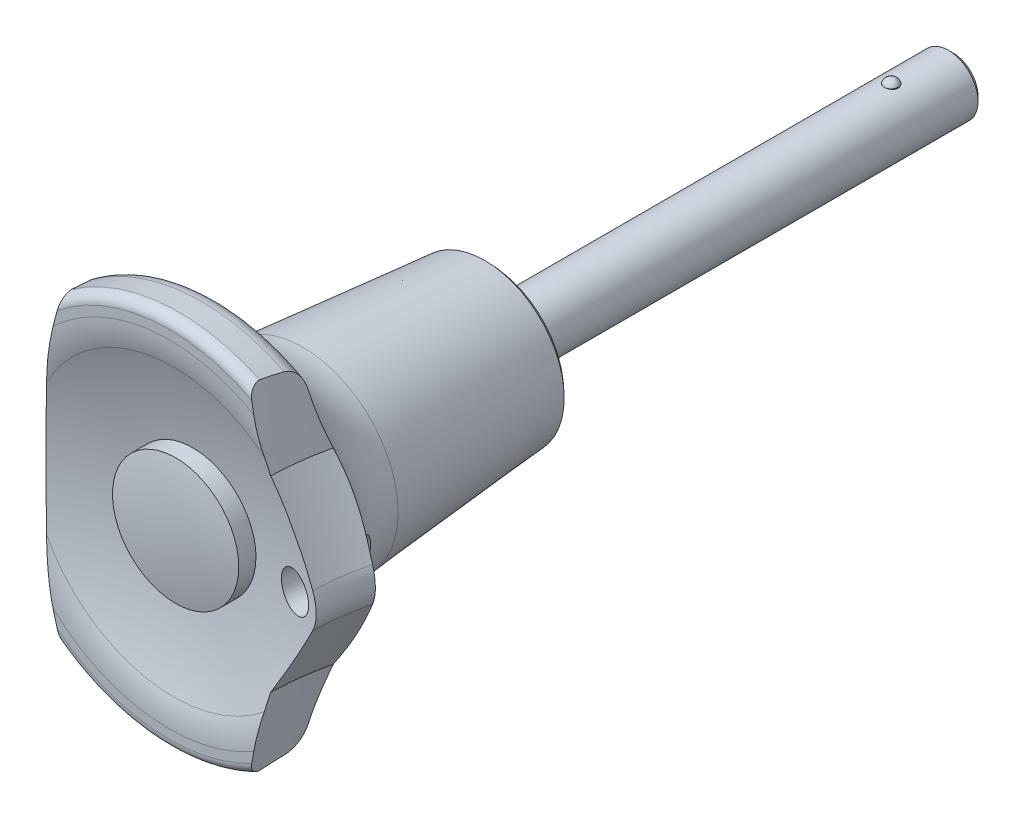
ISO-10303-21;
HEADER;
FILE_DESCRIPTION(('STEP AP214'),'2;1');
FILE_NAME('part.step','',(''),(''),'','','');
FILE_SCHEMA(('AUTOMOTIVE_DESIGN { 1 0 10303 214 1 1 1 1 }'));
ENDSEC;
DATA;
#1=APPLICATION_CONTEXT('core data for automotive mechanical design processes');
#2=APPLICATION_PROTOCOL_DEFINITION('international standard','automotive_design',2000,#1);
#3=PRODUCT_CONTEXT('',#1,'mechanical');
#4=PRODUCT('Part','Part','',(#3));
#5=PRODUCT_RELATED_PRODUCT_CATEGORY('part','',(#4));
#6=PRODUCT_DEFINITION_FORMATION('','',#4);
#7=PRODUCT_DEFINITION_CONTEXT('part definition',#1,'design');
#8=PRODUCT_DEFINITION('design','',#6,#7);
#9=PRODUCT_DEFINITION_SHAPE('','',#8);
#10=(LENGTH_UNIT() NAMED_UNIT(*) SI_UNIT(.MILLI.,.METRE.));
#11=(NAMED_UNIT(*) PLANE_ANGLE_UNIT() SI_UNIT($,.RADIAN.));
#12=(NAMED_UNIT(*) SI_UNIT($,.STERADIAN.) SOLID_ANGLE_UNIT());
#13=UNCERTAINTY_MEASURE_WITH_UNIT(LENGTH_MEASURE(1.E-05),#10,'distance_accuracy_value','');
#14=(GEOMETRIC_REPRESENTATION_CONTEXT(3) GLOBAL_UNCERTAINTY_ASSIGNED_CONTEXT((#13)) GLOBAL_UNIT_ASSIGNED_CONTEXT((#10,
#11,#12)) REPRESENTATION_CONTEXT('',''));
#15=CARTESIAN_POINT('',(0.,0.,0.));
#16=DIRECTION('',(0.,0.,1.));
#17=DIRECTION('',(1.,0.,0.));
#18=AXIS2_PLACEMENT_3D('',#15,#16,#17);
#19=CARTESIAN_POINT('',(0.,2.76,-40.7));
#20=DIRECTION('',(1.,0.,0.));
#21=DIRECTION('',(0.,1.,0.));
#22=AXIS2_PLACEMENT_3D('',#19,#20,#21);
#23=SPHERICAL_SURFACE('',#22,0.74);
#24=CARTESIAN_POINT('',(0.,3.,-40.6999999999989));
#25=DIRECTION('',(0.,1.,3.9331195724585E-13));
#26=DIRECTION('',(0.,-3.9331195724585E-13,1.));
#27=AXIS2_PLACEMENT_3D('',#24,#25,#26);
#28=CIRCLE('',#27,0.7);
#29=CARTESIAN_POINT('',(0.,2.99999999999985,-39.9999999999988));
#30=VERTEX_POINT('',#29);
#31=CARTESIAN_POINT('',(0.,2.99999999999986,-41.3999999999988));
#32=VERTEX_POINT('',#31);
#33=EDGE_CURVE('E597',#30,#32,#28,.F.);
#34=ORIENTED_EDGE('',*,*,#33,.F.);
#35=CARTESIAN_POINT('',(0.,2.99999999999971,-40.6999999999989));
#36=DIRECTION('',(0.,1.,3.9331195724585E-13));
#37=DIRECTION('',(0.,-3.9331195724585E-13,1.));
#38=AXIS2_PLACEMENT_3D('',#35,#36,#37);
#39=CIRCLE('',#38,0.7);
#40=EDGE_CURVE('E594',#32,#30,#39,.F.);
#41=ORIENTED_EDGE('',*,*,#40,.F.);
#42=EDGE_LOOP('',(#34,#41));
#43=FACE_BOUND('',#42,.T.);
#44=ADVANCED_FACE('F14',(#43),#23,.T.);
#45=CARTESIAN_POINT('',(0.,-2.76,-40.7));
#46=DIRECTION('',(1.,0.,0.));
#47=DIRECTION('',(0.,1.,0.));
#48=AXIS2_PLACEMENT_3D('',#45,#46,#47);
#49=SPHERICAL_SURFACE('',#48,0.740000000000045);
#50=CARTESIAN_POINT('',(0.,-3.00000000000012,-40.7000000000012));
#51=DIRECTION('',(0.,1.,3.9331195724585E-13));
#52=DIRECTION('',(0.,-3.9331195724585E-13,1.));
#53=AXIS2_PLACEMENT_3D('',#50,#51,#52);
#54=CIRCLE('',#53,0.7);
#55=CARTESIAN_POINT('',(0.,-3.,-41.4000000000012));
#56=VERTEX_POINT('',#55);
#57=CARTESIAN_POINT('',(0.,-3.,-40.0000000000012));
#58=VERTEX_POINT('',#57);
#59=EDGE_CURVE('E29',#56,#58,#54,.T.);
#60=ORIENTED_EDGE('',*,*,#59,.F.);
#61=CARTESIAN_POINT('',(0.,-2.99999999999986,-40.7000000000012));
#62=DIRECTION('',(0.,1.,3.9331195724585E-13));
#63=DIRECTION('',(0.,-3.9331195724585E-13,1.));
#64=AXIS2_PLACEMENT_3D('',#61,#62,#63);
#65=CIRCLE('',#64,0.7);
#66=EDGE_CURVE('E586',#58,#56,#65,.T.);
#67=ORIENTED_EDGE('',*,*,#66,.F.);
#68=EDGE_LOOP('',(#60,#67));
#69=FACE_BOUND('',#68,.T.);
#70=ADVANCED_FACE('F565',(#69),#49,.T.);
#71=CARTESIAN_POINT('',(0.,0.,-40.7));
#72=DIRECTION('',(0.,1.,3.9331195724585E-13));
#73=DIRECTION('',(0.,-3.9331195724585E-13,1.));
#74=AXIS2_PLACEMENT_3D('',#71,#72,#73);
#75=CYLINDRICAL_SURFACE('',#74,0.7);
#76=CARTESIAN_POINT('',(0.,-3.00000000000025,-41.400000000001));
#77=CARTESIAN_POINT('',(-0.0388250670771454,-3.00002806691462,-41.4000358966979));
#78=CARTESIAN_POINT('',(-0.07762893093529,-2.99924718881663,-41.3967722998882));
#79=CARTESIAN_POINT('',(-0.154051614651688,-2.99627816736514,-41.3839246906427));
#80=CARTESIAN_POINT('',(-0.191672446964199,-2.99409256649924,-41.3743520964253));
#81=CARTESIAN_POINT('',(-0.264735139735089,-2.98852325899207,-41.3491629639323));
#82=CARTESIAN_POINT('',(-0.300176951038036,-2.98513952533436,-41.3335462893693));
#83=CARTESIAN_POINT('',(-0.367944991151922,-2.97754553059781,-41.2967435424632));
#84=CARTESIAN_POINT('',(-0.400270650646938,-2.97333511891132,-41.2755564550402));
#85=CARTESIAN_POINT('',(-0.461461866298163,-2.96446054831,-41.2278099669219));
#86=CARTESIAN_POINT('',(-0.490263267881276,-2.95979017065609,-41.2011694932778));
#87=CARTESIAN_POINT('',(-0.543034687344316,-2.95056475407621,-41.1434443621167));
#88=CARTESIAN_POINT('',(-0.567003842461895,-2.94600973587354,-41.1123589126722));
#89=CARTESIAN_POINT('',(-0.609720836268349,-2.93746875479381,-41.046139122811));
#90=CARTESIAN_POINT('',(-0.628398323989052,-2.93349077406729,-41.0109582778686));
#91=CARTESIAN_POINT('',(-0.659549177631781,-2.92664499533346,-40.937850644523));
#92=CARTESIAN_POINT('',(-0.672023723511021,-2.92377698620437,-40.899924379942));
#93=CARTESIAN_POINT('',(-0.690199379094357,-2.91953955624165,-40.8231061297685));
#94=CARTESIAN_POINT('',(-0.696015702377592,-2.91814467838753,-40.7842428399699));
#95=CARTESIAN_POINT('',(-0.701068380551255,-2.91693510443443,-40.706068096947));
#96=CARTESIAN_POINT('',(-0.700305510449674,-2.917120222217,-40.6667566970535));
#97=CARTESIAN_POINT('',(-0.692313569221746,-2.91902680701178,-40.5896718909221));
#98=CARTESIAN_POINT('',(-0.685220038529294,-2.9207160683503,-40.5518835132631));
#99=CARTESIAN_POINT('',(-0.664983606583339,-2.92538948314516,-40.4780487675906));
#100=CARTESIAN_POINT('',(-0.651840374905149,-2.92837370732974,-40.4420024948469));
#101=CARTESIAN_POINT('',(-0.61975707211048,-2.93533159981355,-40.3723012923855));
#102=CARTESIAN_POINT('',(-0.600766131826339,-2.93931389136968,-40.3386706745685));
#103=CARTESIAN_POINT('',(-0.557562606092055,-2.94781397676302,-40.2750249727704));
#104=CARTESIAN_POINT('',(-0.533349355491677,-2.95233183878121,-40.2450103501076));
#105=CARTESIAN_POINT('',(-0.479681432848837,-2.96153060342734,-40.188672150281));
#106=CARTESIAN_POINT('',(-0.45011245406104,-2.96621278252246,-40.1624575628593));
#107=CARTESIAN_POINT('',(-0.386934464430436,-2.97511303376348,-40.1153336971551));
#108=CARTESIAN_POINT('',(-0.353324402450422,-2.97933098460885,-40.0944258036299));
#109=CARTESIAN_POINT('',(-0.282870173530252,-2.9868450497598,-40.0584749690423));
#110=CARTESIAN_POINT('',(-0.246015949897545,-2.99013815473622,-40.0434511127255));
#111=CARTESIAN_POINT('',(-0.170234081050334,-2.99540575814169,-40.0198604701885));
#112=CARTESIAN_POINT('',(-0.131309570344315,-2.99738219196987,-40.0112842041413));
#113=CARTESIAN_POINT('',(-0.0767145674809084,-2.99905826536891,-40.0040453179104));
#114=CARTESIAN_POINT('',(-0.0613998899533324,-2.99941099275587,-40.0025279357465));
#115=CARTESIAN_POINT('',(-0.0307258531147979,-2.99988170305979,-40.0005064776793));
#116=CARTESIAN_POINT('',(-0.0153666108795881,-3.00000007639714,-40.0000007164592));
#117=CARTESIAN_POINT('',(0.,-3.,-40.0000000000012));
#118=B_SPLINE_CURVE_WITH_KNOTS('',3,(#76,#77,#78,#79,#80,#81,#82,#83,#84,#85,#86,#87,#88,#89,
#90,#91,#92,#93,#94,#95,#96,#97,#98,#99,#100,#101,#102,#103,#104,#105,#106,#107,#108,#109,#110,
#111,#112,#113,#114,#115,#116,#117),.UNSPECIFIED.,.F.,.F.,(4,2,2,2,2,2,2,2,2,2,2,2,2,2,2,2,2,2,
2,2,4),(0.,0.116298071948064,0.232386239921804,0.348477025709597,0.464588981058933,
0.582572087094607,0.700576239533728,0.820082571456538,0.939566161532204,1.05694938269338,
1.17431877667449,1.28923400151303,1.40415550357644,1.52010638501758,1.63607204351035,
1.75489104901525,1.87374102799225,1.99297336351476,2.11203004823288,2.1581833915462,
2.20425978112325),.UNSPECIFIED.);
#119=EDGE_CURVE('E577',#56,#58,#118,.T.);
#120=ORIENTED_EDGE('',*,*,#119,.F.);
#121=ORIENTED_EDGE('',*,*,#59,.T.);
#122=EDGE_LOOP('',(#120,#121));
#123=FACE_BOUND('',#122,.T.);
#124=ADVANCED_FACE('F568',(#123),#75,.T.);
#125=CARTESIAN_POINT('',(0.,0.,-40.7));
#126=DIRECTION('',(0.,1.,3.9331195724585E-13));
#127=DIRECTION('',(0.,-3.9331195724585E-13,1.));
#128=AXIS2_PLACEMENT_3D('',#125,#126,#127);
#129=CYLINDRICAL_SURFACE('',#128,0.7);
#130=CARTESIAN_POINT('',(0.,3.0000000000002,-39.999999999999));
#131=CARTESIAN_POINT('',(-0.0388250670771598,3.0000280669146,-39.9999641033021));
#132=CARTESIAN_POINT('',(-0.0776289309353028,2.99924718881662,-40.0032277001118));
#133=CARTESIAN_POINT('',(-0.154051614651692,2.99627816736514,-40.0160753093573));
#134=CARTESIAN_POINT('',(-0.191672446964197,2.99409256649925,-40.0256479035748));
#135=CARTESIAN_POINT('',(-0.264735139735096,2.98852325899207,-40.0508370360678));
#136=CARTESIAN_POINT('',(-0.300176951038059,2.98513952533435,-40.0664537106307));
#137=CARTESIAN_POINT('',(-0.367944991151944,2.97754553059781,-40.1032564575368));
#138=CARTESIAN_POINT('',(-0.400270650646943,2.97333511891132,-40.1244435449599));
#139=CARTESIAN_POINT('',(-0.461461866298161,2.96446054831,-40.1721900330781));
#140=CARTESIAN_POINT('',(-0.490263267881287,2.95979017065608,-40.1988305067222));
#141=CARTESIAN_POINT('',(-0.543034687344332,2.95056475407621,-40.2565556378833));
#142=CARTESIAN_POINT('',(-0.567003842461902,2.94600973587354,-40.2876410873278));
#143=CARTESIAN_POINT('',(-0.609720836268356,2.93746875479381,-40.353860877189));
#144=CARTESIAN_POINT('',(-0.628398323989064,2.93349077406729,-40.3890417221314));
#145=CARTESIAN_POINT('',(-0.659549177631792,2.92664499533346,-40.4621493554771));
#146=CARTESIAN_POINT('',(-0.672023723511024,2.92377698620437,-40.5000756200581));
#147=CARTESIAN_POINT('',(-0.690199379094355,2.91953955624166,-40.5768938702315));
#148=CARTESIAN_POINT('',(-0.696015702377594,2.91814467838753,-40.6157571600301));
#149=CARTESIAN_POINT('',(-0.701068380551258,2.91693510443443,-40.693931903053));
#150=CARTESIAN_POINT('',(-0.700305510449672,2.917120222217,-40.7332433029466));
#151=CARTESIAN_POINT('',(-0.692313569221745,2.91902680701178,-40.8103281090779));
#152=CARTESIAN_POINT('',(-0.685220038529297,2.92071606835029,-40.8481164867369));
#153=CARTESIAN_POINT('',(-0.664983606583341,2.92538948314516,-40.9219512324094));
#154=CARTESIAN_POINT('',(-0.651840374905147,2.92837370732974,-40.9579975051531));
#155=CARTESIAN_POINT('',(-0.619757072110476,2.93533159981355,-41.0276987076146));
#156=CARTESIAN_POINT('',(-0.600766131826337,2.93931389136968,-41.0613293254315));
#157=CARTESIAN_POINT('',(-0.557562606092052,2.94781397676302,-41.1249750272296));
#158=CARTESIAN_POINT('',(-0.533349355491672,2.95233183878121,-41.1549896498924));
#159=CARTESIAN_POINT('',(-0.479681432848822,2.96153060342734,-41.211327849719));
#160=CARTESIAN_POINT('',(-0.450112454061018,2.96621278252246,-41.2375424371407));
#161=CARTESIAN_POINT('',(-0.386934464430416,2.97511303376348,-41.284666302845));
#162=CARTESIAN_POINT('',(-0.353324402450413,2.97933098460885,-41.3055741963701));
#163=CARTESIAN_POINT('',(-0.282870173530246,2.9868450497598,-41.3415250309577));
#164=CARTESIAN_POINT('',(-0.246015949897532,2.99013815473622,-41.3565488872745));
#165=CARTESIAN_POINT('',(-0.170234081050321,2.99540575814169,-41.3801395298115));
#166=CARTESIAN_POINT('',(-0.131309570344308,2.99738219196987,-41.3887157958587));
#167=CARTESIAN_POINT('',(-0.0767145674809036,2.99905826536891,-41.3959546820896));
#168=CARTESIAN_POINT('',(-0.0613998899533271,2.99941099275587,-41.3974720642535));
#169=CARTESIAN_POINT('',(-0.0307258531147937,2.99988170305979,-41.3994935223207));
#170=CARTESIAN_POINT('',(-0.0153666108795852,3.00000007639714,-41.3999992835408));
#171=CARTESIAN_POINT('',(0.,3.,-41.3999999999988));
#172=B_SPLINE_CURVE_WITH_KNOTS('',3,(#130,#131,#132,#133,#134,#135,#136,#137,#138,#139,#140,
#141,#142,#143,#144,#145,#146,#147,#148,#149,#150,#151,#152,#153,#154,#155,#156,#157,#158,#159,
#160,#161,#162,#163,#164,#165,#166,#167,#168,#169,#170,#171),.UNSPECIFIED.,.F.,.F.,(4,2,2,2,2,2,
2,2,2,2,2,2,2,2,2,2,2,2,2,2,4),(0.,0.116298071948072,0.232386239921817,0.348477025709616,
0.464588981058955,0.582572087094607,0.700576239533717,0.820082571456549,0.939566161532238,
1.05694938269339,1.17431877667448,1.28923400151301,1.40415550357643,1.52010638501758,
1.63607204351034,1.75489104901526,1.87374102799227,1.99297336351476,2.11203004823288,
2.1581833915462,2.20425978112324),.UNSPECIFIED.);
#173=EDGE_CURVE('E585',#30,#32,#172,.T.);
#174=ORIENTED_EDGE('',*,*,#173,.F.);
#175=ORIENTED_EDGE('',*,*,#33,.T.);
#176=EDGE_LOOP('',(#174,#175));
#177=FACE_BOUND('',#176,.T.);
#178=ADVANCED_FACE('F572',(#177),#129,.T.);
#179=CARTESIAN_POINT('',(0.,1.25,-47.));
#180=DIRECTION('',(0.,0.,-1.));
#181=DIRECTION('',(-1.,0.,0.));
#182=AXIS2_PLACEMENT_3D('',#179,#180,#181);
#183=PLANE('',#182);
#184=CARTESIAN_POINT('',(0.,0.,-47.0000000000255));
#185=DIRECTION('',(0.,0.,1.));
#186=DIRECTION('',(1.,0.,0.));
#187=AXIS2_PLACEMENT_3D('',#184,#185,#186);
#188=CIRCLE('',#187,2.49999999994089);
#189=CARTESIAN_POINT('',(2.49999999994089,0.,-47.0000000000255));
#190=VERTEX_POINT('',#189);
#191=EDGE_CURVE('E609',#190,#190,#188,.T.);
#192=ORIENTED_EDGE('',*,*,#191,.F.);
#193=EDGE_LOOP('',(#192));
#194=FACE_BOUND('',#193,.T.);
#195=ADVANCED_FACE('F646',(#194),#183,.T.);
#196=CARTESIAN_POINT('',(0.,0.,-40.7));
#197=DIRECTION('',(0.,1.,3.9331195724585E-13));
#198=DIRECTION('',(0.,-3.9331195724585E-13,1.));
#199=AXIS2_PLACEMENT_3D('',#196,#197,#198);
#200=CYLINDRICAL_SURFACE('',#199,0.7);
#201=CARTESIAN_POINT('',(0.,3.,-41.3999999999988));
#202=CARTESIAN_POINT('',(0.0388250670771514,3.00002806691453,-41.4000358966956));
#203=CARTESIAN_POINT('',(0.077628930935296,2.99924718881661,-41.3967722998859));
#204=CARTESIAN_POINT('',(0.154051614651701,2.99627816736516,-41.3839246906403));
#205=CARTESIAN_POINT('',(0.19167244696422,2.99409256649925,-41.3743520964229));
#206=CARTESIAN_POINT('',(0.264735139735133,2.98852325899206,-41.3491629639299));
#207=CARTESIAN_POINT('',(0.300176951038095,2.98513952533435,-41.3335462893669));
#208=CARTESIAN_POINT('',(0.367944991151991,2.9775455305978,-41.2967435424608));
#209=CARTESIAN_POINT('',(0.400270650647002,2.97333511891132,-41.2755564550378));
#210=CARTESIAN_POINT('',(0.461461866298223,2.96446054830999,-41.2278099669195));
#211=CARTESIAN_POINT('',(0.490263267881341,2.95979017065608,-41.2011694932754));
#212=CARTESIAN_POINT('',(0.543034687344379,2.9505647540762,-41.1434443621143));
#213=CARTESIAN_POINT('',(0.567003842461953,2.94600973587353,-41.1123589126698));
#214=CARTESIAN_POINT('',(0.609720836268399,2.9374687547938,-41.0461391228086));
#215=CARTESIAN_POINT('',(0.628398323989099,2.93349077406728,-41.0109582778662));
#216=CARTESIAN_POINT('',(0.659549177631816,2.92664499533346,-40.9378506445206));
#217=CARTESIAN_POINT('',(0.672023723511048,2.92377698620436,-40.8999243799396));
#218=CARTESIAN_POINT('',(0.690199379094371,2.91953955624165,-40.8231061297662));
#219=CARTESIAN_POINT('',(0.696015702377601,2.91814467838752,-40.7842428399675));
#220=CARTESIAN_POINT('',(0.701068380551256,2.91693510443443,-40.7060680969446));
#221=CARTESIAN_POINT('',(0.700305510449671,2.917120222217,-40.6667566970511));
#222=CARTESIAN_POINT('',(0.692313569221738,2.91902680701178,-40.5896718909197));
#223=CARTESIAN_POINT('',(0.685220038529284,2.9207160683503,-40.5518835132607));
#224=CARTESIAN_POINT('',(0.664983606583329,2.92538948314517,-40.4780487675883));
#225=CARTESIAN_POINT('',(0.651840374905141,2.92837370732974,-40.4420024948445));
#226=CARTESIAN_POINT('',(0.619757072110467,2.93533159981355,-40.3723012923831));
#227=CARTESIAN_POINT('',(0.600766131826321,2.93931389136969,-40.3386706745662));
#228=CARTESIAN_POINT('',(0.557562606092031,2.94781397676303,-40.2750249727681));
#229=CARTESIAN_POINT('',(0.533349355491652,2.95233183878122,-40.2450103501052));
#230=CARTESIAN_POINT('',(0.479681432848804,2.96153060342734,-40.1886721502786));
#231=CARTESIAN_POINT('',(0.450112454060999,2.96621278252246,-40.162457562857));
#232=CARTESIAN_POINT('',(0.386934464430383,2.97511303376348,-40.1153336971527));
#233=CARTESIAN_POINT('',(0.353324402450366,2.97933098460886,-40.0944258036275));
#234=CARTESIAN_POINT('',(0.282870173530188,2.98684504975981,-40.0584749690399));
#235=CARTESIAN_POINT('',(0.246015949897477,2.99013815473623,-40.0434511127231));
#236=CARTESIAN_POINT('',(0.170234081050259,2.99540575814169,-40.0198604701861));
#237=CARTESIAN_POINT('',(0.131309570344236,2.99738219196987,-40.011284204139));
#238=CARTESIAN_POINT('',(0.0767145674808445,2.99905826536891,-40.004045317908));
#239=CARTESIAN_POINT('',(0.0613998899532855,2.99941099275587,-40.0025279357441));
#240=CARTESIAN_POINT('',(0.0307258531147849,2.99988170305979,-40.000506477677));
#241=CARTESIAN_POINT('',(0.0153666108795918,3.00000007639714,-40.0000007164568));
#242=CARTESIAN_POINT('',(0.,3.,-39.9999999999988));
#243=B_SPLINE_CURVE_WITH_KNOTS('',3,(#201,#202,#203,#204,#205,#206,#207,#208,#209,#210,#211,
#212,#213,#214,#215,#216,#217,#218,#219,#220,#221,#222,#223,#224,#225,#226,#227,#228,#229,#230,
#231,#232,#233,#234,#235,#236,#237,#238,#239,#240,#241,#242),.UNSPECIFIED.,.F.,.F.,(4,2,2,2,2,2,
2,2,2,2,2,2,2,2,2,2,2,2,2,2,4),(0.,0.116298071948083,0.23238623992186,0.348477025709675,
0.46458898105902,0.582572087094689,0.700576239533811,0.820082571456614,0.939566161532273,
1.05694938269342,1.17431877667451,1.28923400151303,1.40415550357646,1.5201063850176,
1.63607204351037,1.7548910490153,1.87374102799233,1.99297336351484,2.11203004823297,
2.15818339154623,2.20425978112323),.UNSPECIFIED.);
#244=EDGE_CURVE('E606',#32,#30,#243,.T.);
#245=ORIENTED_EDGE('',*,*,#244,.F.);
#246=ORIENTED_EDGE('',*,*,#40,.T.);
#247=EDGE_LOOP('',(#245,#246));
#248=FACE_BOUND('',#247,.T.);
#249=ADVANCED_FACE('F624',(#248),#200,.T.);
#250=CARTESIAN_POINT('',(0.,0.,-40.7));
#251=DIRECTION('',(0.,1.,3.9331195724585E-13));
#252=DIRECTION('',(0.,-3.9331195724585E-13,1.));
#253=AXIS2_PLACEMENT_3D('',#250,#251,#252);
#254=CYLINDRICAL_SURFACE('',#253,0.7);
#255=CARTESIAN_POINT('',(0.,-3.,-40.0000000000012));
#256=CARTESIAN_POINT('',(0.0388250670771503,-3.00002806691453,-39.9999641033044));
#257=CARTESIAN_POINT('',(0.0776289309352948,-2.99924718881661,-40.0032277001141));
#258=CARTESIAN_POINT('',(0.1540516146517,-2.99627816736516,-40.0160753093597));
#259=CARTESIAN_POINT('',(0.19167244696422,-2.99409256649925,-40.0256479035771));
#260=CARTESIAN_POINT('',(0.264735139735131,-2.98852325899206,-40.0508370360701));
#261=CARTESIAN_POINT('',(0.300176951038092,-2.98513952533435,-40.0664537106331));
#262=CARTESIAN_POINT('',(0.367944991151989,-2.9775455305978,-40.1032564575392));
#263=CARTESIAN_POINT('',(0.400270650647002,-2.97333511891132,-40.1244435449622));
#264=CARTESIAN_POINT('',(0.461461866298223,-2.96446054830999,-40.1721900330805));
#265=CARTESIAN_POINT('',(0.490263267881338,-2.95979017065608,-40.1988305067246));
#266=CARTESIAN_POINT('',(0.543034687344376,-2.9505647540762,-40.2565556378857));
#267=CARTESIAN_POINT('',(0.567003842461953,-2.94600973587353,-40.2876410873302));
#268=CARTESIAN_POINT('',(0.6097208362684,-2.9374687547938,-40.3538608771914));
#269=CARTESIAN_POINT('',(0.628398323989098,-2.93349077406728,-40.3890417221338));
#270=CARTESIAN_POINT('',(0.659549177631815,-2.92664499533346,-40.4621493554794));
#271=CARTESIAN_POINT('',(0.672023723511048,-2.92377698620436,-40.5000756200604));
#272=CARTESIAN_POINT('',(0.690199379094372,-2.91953955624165,-40.5768938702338));
#273=CARTESIAN_POINT('',(0.696015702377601,-2.91814467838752,-40.6157571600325));
#274=CARTESIAN_POINT('',(0.701068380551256,-2.91693510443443,-40.6939319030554));
#275=CARTESIAN_POINT('',(0.700305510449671,-2.917120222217,-40.7332433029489));
#276=CARTESIAN_POINT('',(0.692313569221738,-2.91902680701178,-40.8103281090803));
#277=CARTESIAN_POINT('',(0.685220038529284,-2.9207160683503,-40.8481164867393));
#278=CARTESIAN_POINT('',(0.664983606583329,-2.92538948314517,-40.9219512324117));
#279=CARTESIAN_POINT('',(0.65184037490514,-2.92837370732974,-40.9579975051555));
#280=CARTESIAN_POINT('',(0.619757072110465,-2.93533159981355,-41.0276987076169));
#281=CARTESIAN_POINT('',(0.600766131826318,-2.93931389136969,-41.0613293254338));
#282=CARTESIAN_POINT('',(0.557562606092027,-2.94781397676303,-41.1249750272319));
#283=CARTESIAN_POINT('',(0.53334935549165,-2.95233183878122,-41.1549896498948));
#284=CARTESIAN_POINT('',(0.479681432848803,-2.96153060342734,-41.2113278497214));
#285=CARTESIAN_POINT('',(0.450112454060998,-2.96621278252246,-41.237542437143));
#286=CARTESIAN_POINT('',(0.386934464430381,-2.97511303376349,-41.2846663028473));
#287=CARTESIAN_POINT('',(0.353324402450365,-2.97933098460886,-41.3055741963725));
#288=CARTESIAN_POINT('',(0.282870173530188,-2.98684504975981,-41.3415250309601));
#289=CARTESIAN_POINT('',(0.246015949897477,-2.99013815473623,-41.3565488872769));
#290=CARTESIAN_POINT('',(0.17023408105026,-2.99540575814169,-41.3801395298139));
#291=CARTESIAN_POINT('',(0.131309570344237,-2.99738219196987,-41.388715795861));
#292=CARTESIAN_POINT('',(0.0767145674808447,-2.99905826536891,-41.395954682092));
#293=CARTESIAN_POINT('',(0.0613998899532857,-2.99941099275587,-41.3974720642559));
#294=CARTESIAN_POINT('',(0.0307258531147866,-2.99988170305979,-41.399493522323));
#295=CARTESIAN_POINT('',(0.0153666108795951,-3.00000007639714,-41.3999992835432));
#296=CARTESIAN_POINT('',(0.,-3.,-41.4000000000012));
#297=B_SPLINE_CURVE_WITH_KNOTS('',3,(#255,#256,#257,#258,#259,#260,#261,#262,#263,#264,#265,
#266,#267,#268,#269,#270,#271,#272,#273,#274,#275,#276,#277,#278,#279,#280,#281,#282,#283,#284,
#285,#286,#287,#288,#289,#290,#291,#292,#293,#294,#295,#296),.UNSPECIFIED.,.F.,.F.,(4,2,2,2,2,2,
2,2,2,2,2,2,2,2,2,2,2,2,2,2,4),(0.,0.116298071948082,0.23238623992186,0.348477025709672,
0.464588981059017,0.582572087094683,0.700576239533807,0.820082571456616,0.939566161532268,
1.05694938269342,1.17431877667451,1.28923400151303,1.40415550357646,1.52010638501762,
1.63607204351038,1.75489104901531,1.87374102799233,1.99297336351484,2.11203004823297,
2.15818339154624,2.20425978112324),.UNSPECIFIED.);
#298=EDGE_CURVE('E603',#58,#56,#297,.T.);
#299=ORIENTED_EDGE('',*,*,#298,.F.);
#300=ORIENTED_EDGE('',*,*,#66,.T.);
#301=EDGE_LOOP('',(#299,#300));
#302=FACE_BOUND('',#301,.T.);
#303=ADVANCED_FACE('F605',(#302),#254,.T.);
#304=CARTESIAN_POINT('',(0.,0.,-46.5000000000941));
#305=DIRECTION('',(0.,0.,1.));
#306=DIRECTION('',(1.,0.,0.));
#307=AXIS2_PLACEMENT_3D('',#304,#305,#306);
#308=CONICAL_SURFACE('',#307,2.99999999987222,0.785398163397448);
#309=ORIENTED_EDGE('',*,*,#191,.T.);
#310=EDGE_LOOP('',(#309));
#311=FACE_BOUND('',#310,.T.);
#312=CARTESIAN_POINT('',(0.,0.,-46.5));
#313=DIRECTION('',(0.,0.,1.));
#314=DIRECTION('',(1.,0.,0.));
#315=AXIS2_PLACEMENT_3D('',#312,#313,#314);
#316=CIRCLE('',#315,3.);
#317=CARTESIAN_POINT('',(3.,0.,-46.5));
#318=VERTEX_POINT('',#317);
#319=EDGE_CURVE('E24',#318,#318,#316,.T.);
#320=ORIENTED_EDGE('',*,*,#319,.F.);
#321=EDGE_LOOP('',(#320));
#322=FACE_BOUND('',#321,.T.);
#323=ADVANCED_FACE('F623',(#311,#322),#308,.T.);
#324=CARTESIAN_POINT('',(0.,0.,-15.125));
#325=DIRECTION('',(0.,0.,1.));
#326=DIRECTION('',(1.,0.,0.));
#327=AXIS2_PLACEMENT_3D('',#324,#325,#326);
#328=CYLINDRICAL_SURFACE('',#327,3.);
#329=CARTESIAN_POINT('',(0.,0.,0.));
#330=DIRECTION('',(0.,0.,-1.));
#331=DIRECTION('',(-1.,0.,0.));
#332=AXIS2_PLACEMENT_3D('',#329,#330,#331);
#333=CIRCLE('',#332,3.);
#334=CARTESIAN_POINT('',(-3.,0.,0.));
#335=VERTEX_POINT('',#334);
#336=EDGE_CURVE('E9',#335,#335,#333,.F.);
#337=ORIENTED_EDGE('',*,*,#336,.F.);
#338=EDGE_LOOP('',(#337));
#339=FACE_BOUND('',#338,.T.);
#340=ORIENTED_EDGE('',*,*,#173,.T.);
#341=ORIENTED_EDGE('',*,*,#244,.T.);
#342=EDGE_LOOP('',(#340,#341));
#343=FACE_BOUND('',#342,.T.);
#344=ORIENTED_EDGE('',*,*,#119,.T.);
#345=ORIENTED_EDGE('',*,*,#298,.T.);
#346=EDGE_LOOP('',(#344,#345));
#347=FACE_BOUND('',#346,.T.);
#348=ORIENTED_EDGE('',*,*,#319,.T.);
#349=EDGE_LOOP('',(#348));
#350=FACE_BOUND('',#349,.T.);
#351=ADVANCED_FACE('F16',(#339,#343,#347,#350),#328,.T.);
#352=CARTESIAN_POINT('',(0.,1.03504969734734E-13,0.667307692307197));
#353=DIRECTION('',(1.,0.,0.));
#354=DIRECTION('',(0.,1.,0.));
#355=AXIS2_PLACEMENT_3D('',#352,#353,#354);
#356=SPHERICAL_SURFACE('',#355,31.8326923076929);
#357=CARTESIAN_POINT('',(0.,0.,31.85));
#358=DIRECTION('',(0.,0.,1.));
#359=DIRECTION('',(1.,0.,0.));
#360=AXIS2_PLACEMENT_3D('',#357,#358,#359);
#361=CIRCLE('',#360,6.4);
#362=CARTESIAN_POINT('',(6.4,0.,31.85));
#363=VERTEX_POINT('',#362);
#364=EDGE_CURVE('E536',#363,#363,#361,.F.);
#365=ORIENTED_EDGE('',*,*,#364,.F.);
#366=EDGE_LOOP('',(#365));
#367=FACE_BOUND('',#366,.T.);
#368=ADVANCED_FACE('F541',(#367),#356,.T.);
#369=CARTESIAN_POINT('',(0.,0.,24.05));
#370=DIRECTION('',(0.,0.,1.));
#371=DIRECTION('',(1.,0.,0.));
#372=AXIS2_PLACEMENT_3D('',#369,#370,#371);
#373=CYLINDRICAL_SURFACE('',#372,6.4);
#374=ORIENTED_EDGE('',*,*,#364,.T.);
#375=EDGE_LOOP('',(#374));
#376=FACE_BOUND('',#375,.T.);
#377=CARTESIAN_POINT('',(6.4,0.,30.1110590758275));
#378=CARTESIAN_POINT('',(6.40000129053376,-0.179810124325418,30.111059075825));
#379=CARTESIAN_POINT('',(6.39241914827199,-0.359599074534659,30.1110590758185));
#380=CARTESIAN_POINT('',(6.3621435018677,-0.717959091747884,30.1110590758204));
#381=CARTESIAN_POINT('',(6.3394460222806,-0.896529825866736,30.1110590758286));
#382=CARTESIAN_POINT('',(6.2790684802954,-1.25128110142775,30.1110590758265));
#383=CARTESIAN_POINT('',(6.24137507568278,-1.42745936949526,30.1110590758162));
#384=CARTESIAN_POINT('',(6.15125799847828,-1.77607703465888,30.1110590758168));
#385=CARTESIAN_POINT('',(6.09882894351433,-1.94851504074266,30.1110590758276));
#386=CARTESIAN_POINT('',(5.9796699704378,-2.2882129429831,30.1110590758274));
#387=CARTESIAN_POINT('',(5.91295217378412,-2.45547709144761,30.1110590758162));
#388=CARTESIAN_POINT('',(5.76563661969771,-2.78385147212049,30.1110590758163));
#389=CARTESIAN_POINT('',(5.68503375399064,-2.94495941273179,30.1110590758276));
#390=CARTESIAN_POINT('',(5.51059240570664,-3.25971260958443,30.1110590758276));
#391=CARTESIAN_POINT('',(5.41676212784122,-3.41336241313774,30.1110590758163));
#392=CARTESIAN_POINT('',(5.21645805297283,-3.7122693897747,30.1110590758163));
#393=CARTESIAN_POINT('',(5.10997960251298,-3.85752344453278,30.1110590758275));
#394=CARTESIAN_POINT('',(4.88519374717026,-4.13850742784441,30.1110590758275));
#395=CARTESIAN_POINT('',(4.7668894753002,-4.27423986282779,30.1110590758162));
#396=CARTESIAN_POINT('',(4.5192234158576,-4.53530651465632,30.1110590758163));
#397=CARTESIAN_POINT('',(4.38985756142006,-4.66063687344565,30.1110590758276));
#398=CARTESIAN_POINT('',(4.12107041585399,-4.89991253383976,30.1110590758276));
#399=CARTESIAN_POINT('',(3.98165245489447,-5.01386157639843,30.1110590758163));
#400=CARTESIAN_POINT('',(3.69366097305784,-5.22965167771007,30.1110590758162));
#401=CARTESIAN_POINT('',(3.54508409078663,-5.33148825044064,30.1110590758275));
#402=CARTESIAN_POINT('',(3.2399371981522,-5.52224318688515,30.1110590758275));
#403=CARTESIAN_POINT('',(3.08337030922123,-5.61116654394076,30.1110590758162));
#404=CARTESIAN_POINT('',(2.76324420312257,-5.77554056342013,30.1110590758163));
#405=CARTESIAN_POINT('',(2.59968242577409,-5.85098623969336,30.1110590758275));
#406=CARTESIAN_POINT('',(2.26684452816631,-5.98780235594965,30.1110590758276));
#407=CARTESIAN_POINT('',(2.09757055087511,-6.04917800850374,30.1110590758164));
#408=CARTESIAN_POINT('',(1.75439473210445,-6.15747441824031,30.1110590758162));
#409=CARTESIAN_POINT('',(1.58049120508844,-6.20438983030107,30.1110590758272));
#410=CARTESIAN_POINT('',(1.22940084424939,-6.283384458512,30.1110590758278));
#411=CARTESIAN_POINT('',(1.05221523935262,-6.31546911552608,30.1110590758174));
#412=CARTESIAN_POINT('',(0.695754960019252,-6.36461764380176,30.1110590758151));
#413=CARTESIAN_POINT('',(0.516479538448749,-6.38167596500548,30.1110590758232));
#414=CARTESIAN_POINT('',(-0.0224375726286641,-6.41003711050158,30.1110590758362));
#415=CARTESIAN_POINT('',(-0.383552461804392,-6.39861178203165,30.1110590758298));
#416=CARTESIAN_POINT('',(-1.098541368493,-6.31529390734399,30.1110590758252));
#417=CARTESIAN_POINT('',(-1.45241538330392,-6.24340133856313,30.1110590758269));
#418=CARTESIAN_POINT('',(-2.14312422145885,-6.0412270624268,30.1110590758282));
#419=CARTESIAN_POINT('',(-2.47995902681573,-5.91094529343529,30.1110590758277));
#420=CARTESIAN_POINT('',(-3.12696102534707,-5.59568095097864,30.1110590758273));
#421=CARTESIAN_POINT('',(-3.4371282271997,-5.41069839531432,30.1110590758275));
#422=CARTESIAN_POINT('',(-4.0220080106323,-4.99128634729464,30.1110590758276));
#423=CARTESIAN_POINT('',(-4.29672060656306,-4.75685687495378,30.1110590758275));
#424=CARTESIAN_POINT('',(-4.80288833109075,-4.24520495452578,30.1110590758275));
#425=CARTESIAN_POINT('',(-5.0343434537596,-3.96798250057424,30.1110590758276));
#426=CARTESIAN_POINT('',(-5.44742715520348,-3.37861432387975,30.1110590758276));
#427=CARTESIAN_POINT('',(-5.62905572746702,-3.06646859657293,30.1110590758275));
#428=CARTESIAN_POINT('',(-5.9373300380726,-2.41611476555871,30.1110590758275));
#429=CARTESIAN_POINT('',(-6.06397577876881,-2.0779066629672,30.1110590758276));
#430=CARTESIAN_POINT('',(-6.25868942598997,-1.38502883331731,30.1110590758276));
#431=CARTESIAN_POINT('',(-6.32675733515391,-1.03035910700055,30.1110590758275));
#432=CARTESIAN_POINT('',(-6.40238305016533,-0.314626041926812,30.1110590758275));
#433=CARTESIAN_POINT('',(-6.4099408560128,0.0464372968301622,30.1110590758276));
#434=CARTESIAN_POINT('',(-6.36433185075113,0.764708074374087,30.1110590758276));
#435=CARTESIAN_POINT('',(-6.31116503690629,1.12191551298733,30.1110590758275));
#436=CARTESIAN_POINT('',(-6.14561593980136,1.82233442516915,30.1110590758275));
#437=CARTESIAN_POINT('',(-6.03323365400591,2.16554589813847,30.1110590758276));
#438=CARTESIAN_POINT('',(-5.75244417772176,2.82823003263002,30.1110590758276));
#439=CARTESIAN_POINT('',(-5.58403699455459,3.1477026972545,30.1110590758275));
#440=CARTESIAN_POINT('',(-5.1959770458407,3.75384041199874,30.1110590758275));
#441=CARTESIAN_POINT('',(-4.97632428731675,4.04050546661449,30.1110590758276));
#442=CARTESIAN_POINT('',(-4.49201316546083,4.57289025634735,30.1110590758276));
#443=CARTESIAN_POINT('',(-4.22735478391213,4.8186099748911,30.1110590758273));
#444=CARTESIAN_POINT('',(-3.66052736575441,5.26212983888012,30.1110590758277));
#445=CARTESIAN_POINT('',(-3.35835831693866,5.45992996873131,30.1110590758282));
#446=CARTESIAN_POINT('',(-2.72515445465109,5.80199137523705,30.111059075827));
#447=CARTESIAN_POINT('',(-2.39411967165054,5.94625270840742,30.1110590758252));
#448=CARTESIAN_POINT('',(-1.71233203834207,6.17715664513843,30.1110590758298));
#449=CARTESIAN_POINT('',(-1.36157919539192,6.26379927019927,30.1110590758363));
#450=CARTESIAN_POINT('',(-0.828635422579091,6.34869298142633,30.1110590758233));
#451=CARTESIAN_POINT('',(-0.649753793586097,6.36947821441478,30.1110590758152));
#452=CARTESIAN_POINT('',(-0.290893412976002,6.3959118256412,30.1110590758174));
#453=CARTESIAN_POINT('',(-0.110915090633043,6.40156578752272,30.1110590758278));
#454=CARTESIAN_POINT('',(0.248931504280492,6.39769010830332,30.1110590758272));
#455=CARTESIAN_POINT('',(0.428799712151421,6.38815488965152,30.1110590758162));
#456=CARTESIAN_POINT('',(0.787030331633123,6.35397041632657,30.1110590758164));
#457=CARTESIAN_POINT('',(0.96539327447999,6.32932674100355,30.1110590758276));
#458=CARTESIAN_POINT('',(1.31947460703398,6.2650918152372,30.1110590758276));
#459=CARTESIAN_POINT('',(1.49519199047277,6.22549501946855,30.1110590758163));
#460=CARTESIAN_POINT('',(1.84260157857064,6.13165408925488,30.1110590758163));
#461=CARTESIAN_POINT('',(2.01429524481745,6.07741536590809,30.1110590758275));
#462=CARTESIAN_POINT('',(2.35256975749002,5.95464555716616,30.1110590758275));
#463=CARTESIAN_POINT('',(2.51914859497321,5.88610893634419,30.1110590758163));
#464=CARTESIAN_POINT('',(2.84587864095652,5.7352714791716,30.1110590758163));
#465=CARTESIAN_POINT('',(3.00603219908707,5.65297573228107,30.1110590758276));
#466=CARTESIAN_POINT('',(3.31889024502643,5.47515780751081,30.1110590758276));
#467=CARTESIAN_POINT('',(3.47159225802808,5.37963127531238,30.1110590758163));
#468=CARTESIAN_POINT('',(3.7683497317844,5.17608944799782,30.1110590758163));
#469=CARTESIAN_POINT('',(3.91240836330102,5.06807877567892,30.1110590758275));
#470=CARTESIAN_POINT('',(4.19095341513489,4.84027769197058,30.1110590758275));
#471=CARTESIAN_POINT('',(4.32543729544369,4.72048417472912,30.1110590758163));
#472=CARTESIAN_POINT('',(4.58378691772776,4.47003941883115,30.1110590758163));
#473=CARTESIAN_POINT('',(4.70765655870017,4.33939220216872,30.1110590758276));
#474=CARTESIAN_POINT('',(4.94402627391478,4.0680460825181,30.1110590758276));
#475=CARTESIAN_POINT('',(5.05651927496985,3.92734101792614,30.1110590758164));
#476=CARTESIAN_POINT('',(5.26920889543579,3.63700546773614,30.1110590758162));
#477=CARTESIAN_POINT('',(5.36941003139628,3.48737829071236,30.1110590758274));
#478=CARTESIAN_POINT('',(5.55693134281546,3.18008480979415,30.1110590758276));
#479=CARTESIAN_POINT('',(5.6442405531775,3.02241181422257,30.1110590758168));
#480=CARTESIAN_POINT('',(5.80522542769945,2.70032605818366,30.1110590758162));
#481=CARTESIAN_POINT('',(5.87890606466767,2.53591578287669,30.1110590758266));
#482=CARTESIAN_POINT('',(6.01208998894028,2.20161657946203,30.1110590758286));
#483=CARTESIAN_POINT('',(6.07160584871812,2.03173266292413,30.1110590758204));
#484=CARTESIAN_POINT('',(6.17610679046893,1.68761339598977,30.1110590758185));
#485=CARTESIAN_POINT('',(6.22109569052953,1.51337920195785,30.111059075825));
#486=CARTESIAN_POINT('',(6.30560169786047,1.11794110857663,30.1110590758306));
#487=CARTESIAN_POINT('',(6.34097102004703,0.895838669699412,30.1110590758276));
#488=CARTESIAN_POINT('',(6.38816936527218,0.449146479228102,30.1110590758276));
#489=CARTESIAN_POINT('',(6.39999838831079,0.22455672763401,30.1110590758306));
#490=CARTESIAN_POINT('',(6.4,0.,30.1110590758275));
#491=B_SPLINE_CURVE_WITH_KNOTS('',3,(#377,#378,#379,#380,#381,#382,#383,#384,#385,#386,#387,
#388,#389,#390,#391,#392,#393,#394,#395,#396,#397,#398,#399,#400,#401,#402,#403,#404,#405,#406,
#407,#408,#409,#410,#411,#412,#413,#414,#415,#416,#417,#418,#419,#420,#421,#422,#423,#424,#425,
#426,#427,#428,#429,#430,#431,#432,#433,#434,#435,#436,#437,#438,#439,#440,#441,#442,#443,#444,
#445,#446,#447,#448,#449,#450,#451,#452,#453,#454,#455,#456,#457,#458,#459,#460,#461,#462,#463,
#464,#465,#466,#467,#468,#469,#470,#471,#472,#473,#474,#475,#476,#477,#478,#479,#480,#481,#482,
#483,#484,#485,#486,#487,#488,#489,#490),.UNSPECIFIED.,.T.,.F.,(4,2,2,2,2,2,2,2,2,2,2,2,2,2,2,2,
2,2,2,2,2,2,2,2,2,2,2,2,2,2,2,2,2,2,2,2,2,2,2,2,2,2,2,2,2,2,2,2,2,2,2,2,2,2,2,2,4),(0.,
0.539234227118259,1.07861033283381,1.61846741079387,2.15852193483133,2.69812012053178,
3.23791724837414,3.77738101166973,4.31704387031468,4.8565641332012,5.39628361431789,
5.93582510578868,6.47556580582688,7.01509723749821,7.55482786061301,8.09435820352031,
8.63408774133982,9.17361911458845,9.71334968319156,10.7916501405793,11.8699510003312,
12.9482529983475,14.0265546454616,15.1048558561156,16.1831572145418,17.2614587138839,
18.3397601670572,19.4180615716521,20.4963629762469,21.5746644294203,22.6529659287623,
23.7312672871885,24.8095684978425,25.8878701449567,26.966172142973,28.0444730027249,
29.1227734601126,29.6625040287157,30.2020354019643,30.7417649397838,31.2812952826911,
31.8210259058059,32.3605573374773,32.9002980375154,33.4398395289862,33.9795590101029,
34.5190792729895,35.0587421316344,35.59820589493,36.1380030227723,36.6776012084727,
37.2176557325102,37.7575128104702,38.2968889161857,38.836123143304,39.5095483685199,
40.1829735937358),.UNSPECIFIED.);
#492=CARTESIAN_POINT('',(6.4,0.,30.1110590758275));
#493=VERTEX_POINT('',#492);
#494=EDGE_CURVE('E550',#493,#493,#491,.T.);
#495=ORIENTED_EDGE('',*,*,#494,.F.);
#496=EDGE_LOOP('',(#495));
#497=FACE_BOUND('',#496,.T.);
#498=ADVANCED_FACE('F543',(#376,#497),#373,.T.);
#499=CARTESIAN_POINT('',(0.,0.,31.5));
#500=DIRECTION('',(0.,0.,1.));
#501=DIRECTION('',(1.,0.,0.));
#502=AXIS2_PLACEMENT_3D('',#499,#500,#501);
#503=CONICAL_SURFACE('',#502,19.,0.0872664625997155);
#504=CARTESIAN_POINT('',(-11.2367166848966,-15.0725210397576,29.2154159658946));
#505=CARTESIAN_POINT('',(-11.2176777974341,-15.0969210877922,29.3089473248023));
#506=CARTESIAN_POINT('',(-11.1992554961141,-15.1208018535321,29.4027394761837));
#507=CARTESIAN_POINT('',(-11.1636714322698,-15.1675195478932,29.5907332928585));
#508=CARTESIAN_POINT('',(-11.1465086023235,-15.1903573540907,29.6849345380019));
#509=CARTESIAN_POINT('',(-11.1134475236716,-15.2350129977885,29.8737414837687));
#510=CARTESIAN_POINT('',(-11.0975485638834,-15.2568314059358,29.9683469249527));
#511=CARTESIAN_POINT('',(-11.0670196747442,-15.2994695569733,30.1579580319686));
#512=CARTESIAN_POINT('',(-11.0523893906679,-15.3202895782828,30.2529635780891));
#513=CARTESIAN_POINT('',(-11.0244032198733,-15.3609498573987,30.4433702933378));
#514=CARTESIAN_POINT('',(-11.0110473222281,-15.3807901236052,30.5387714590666));
#515=CARTESIAN_POINT('',(-10.9856156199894,-15.4195080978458,30.7299680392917));
#516=CARTESIAN_POINT('',(-10.973540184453,-15.4383855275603,30.8257635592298));
#517=CARTESIAN_POINT('',(-10.9506761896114,-15.4751926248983,31.0177468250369));
#518=CARTESIAN_POINT('',(-10.9398883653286,-15.4931217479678,31.1139347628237));
#519=CARTESIAN_POINT('',(-10.9196071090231,-15.5280445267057,31.3067014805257));
#520=CARTESIAN_POINT('',(-10.9101147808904,-15.5450373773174,31.4032805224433));
#521=CARTESIAN_POINT('',(-10.9012791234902,-15.5615588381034,31.5));
#522=B_SPLINE_CURVE_WITH_KNOTS('',3,(#504,#505,#506,#507,#508,#509,#510,#511,#512,#513,#514,
#515,#516,#517,#518,#519,#520,#521),.UNSPECIFIED.,.F.,.F.,(4,2,2,2,2,2,2,2,4),(0.,
0.295552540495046,0.59085163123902,0.885983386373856,1.18103235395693,1.47607879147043,
1.77121003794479,2.06650896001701,2.36205795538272),.UNSPECIFIED.);
#523=CARTESIAN_POINT('',(-11.2367166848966,-15.0725210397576,29.2154159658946));
#524=VERTEX_POINT('',#523);
#525=CARTESIAN_POINT('',(-10.9012791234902,-15.5615588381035,31.5));
#526=VERTEX_POINT('',#525);
#527=EDGE_CURVE('E911',#524,#526,#522,.T.);
#528=ORIENTED_EDGE('',*,*,#527,.F.);
#529=CARTESIAN_POINT('',(0.,0.,29.2154159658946));
#530=DIRECTION('',(0.,0.,1.));
#531=DIRECTION('',(1.,0.,0.));
#532=AXIS2_PLACEMENT_3D('',#529,#530,#531);
#533=CIRCLE('',#532,18.8001247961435);
#534=CARTESIAN_POINT('',(8.39031074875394,-16.8240119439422,29.2154159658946));
#535=VERTEX_POINT('',#534);
#536=EDGE_CURVE('E240',#535,#524,#533,.F.);
#537=ORIENTED_EDGE('',*,*,#536,.F.);
#538=CARTESIAN_POINT('',(8.39031074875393,-16.8240119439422,29.2154159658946));
#539=CARTESIAN_POINT('',(8.36371883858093,-16.8557405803,29.4043278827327));
#540=CARTESIAN_POINT('',(8.33910921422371,-16.8864008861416,29.5936974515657));
#541=CARTESIAN_POINT('',(8.29388552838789,-16.9456264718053,29.9731315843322));
#542=CARTESIAN_POINT('',(8.27326927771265,-16.9741928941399,30.1631957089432));
#543=CARTESIAN_POINT('',(8.23603410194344,-17.0293070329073,30.544006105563));
#544=CARTESIAN_POINT('',(8.21941516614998,-17.0558547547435,30.7347523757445));
#545=CARTESIAN_POINT('',(8.19018148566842,-17.1069883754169,31.1169213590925));
#546=CARTESIAN_POINT('',(8.17756894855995,-17.1315731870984,31.3083443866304));
#547=CARTESIAN_POINT('',(8.16697223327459,-17.155190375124,31.4999976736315));
#548=B_SPLINE_CURVE_WITH_KNOTS('',3,(#538,#539,#540,#541,#542,#543,#544,#545,#546,#547),
.UNSPECIFIED.,.F.,.F.,(4,2,2,2,4),(0.,0.580169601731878,1.16002024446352,1.73986933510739,
2.32003737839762),.UNSPECIFIED.);
#549=CARTESIAN_POINT('',(8.16697214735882,-17.1551906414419,31.4999988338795));
#550=VERTEX_POINT('',#549);
#551=EDGE_CURVE('E170',#535,#550,#548,.T.);
#552=ORIENTED_EDGE('',*,*,#551,.T.);
#553=CARTESIAN_POINT('',(0.,0.,31.5));
#554=DIRECTION('',(0.,0.,1.));
#555=DIRECTION('',(1.,0.,0.));
#556=AXIS2_PLACEMENT_3D('',#553,#554,#555);
#557=CIRCLE('',#556,19.);
#558=EDGE_CURVE('E466',#526,#550,#557,.T.);
#559=ORIENTED_EDGE('',*,*,#558,.F.);
#560=EDGE_LOOP('',(#528,#537,#552,#559));
#561=FACE_BOUND('',#560,.T.);
#562=ADVANCED_FACE('F547',(#561),#503,.T.);
#563=CARTESIAN_POINT('',(0.,0.,31.5));
#564=DIRECTION('',(0.,0.,1.));
#565=DIRECTION('',(1.,0.,0.));
#566=AXIS2_PLACEMENT_3D('',#563,#564,#565);
#567=TOROIDAL_SURFACE('',#566,18.,1.);
#568=CARTESIAN_POINT('',(8.16697219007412,-17.1551906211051,31.499997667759));
#569=CARTESIAN_POINT('',(8.16610411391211,-17.1556060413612,31.5236792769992));
#570=CARTESIAN_POINT('',(8.16544722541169,-17.1549841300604,31.5473747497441));
#571=CARTESIAN_POINT('',(8.16455688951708,-17.1516830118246,31.5946216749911));
#572=CARTESIAN_POINT('',(8.16432329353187,-17.1490045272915,31.6181731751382));
#573=CARTESIAN_POINT('',(8.16425861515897,-17.1379549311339,31.688092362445));
#574=CARTESIAN_POINT('',(8.16505301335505,-17.1265741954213,31.7340189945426));
#575=CARTESIAN_POINT('',(8.16821542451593,-17.0963987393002,31.8232098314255));
#576=CARTESIAN_POINT('',(8.17058197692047,-17.077610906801,31.8664764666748));
#577=CARTESIAN_POINT('',(8.17670292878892,-17.0335448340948,31.9494901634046));
#578=CARTESIAN_POINT('',(8.18045877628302,-17.008259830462,31.9892334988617));
#579=CARTESIAN_POINT('',(8.18937318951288,-16.9507343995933,32.0665851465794));
#580=CARTESIAN_POINT('',(8.19459729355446,-16.9181889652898,32.1039574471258));
#581=CARTESIAN_POINT('',(8.20607879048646,-16.8482742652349,32.1736619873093));
#582=CARTESIAN_POINT('',(8.21233651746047,-16.8109034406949,32.2059925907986));
#583=CARTESIAN_POINT('',(8.22684468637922,-16.7253510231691,32.2708321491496));
#584=CARTESIAN_POINT('',(8.23525121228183,-16.6764328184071,32.3023321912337));
#585=CARTESIAN_POINT('',(8.25285140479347,-16.574800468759,32.3582132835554));
#586=CARTESIAN_POINT('',(8.26204594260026,-16.5220821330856,32.3825863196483));
#587=CARTESIAN_POINT('',(8.28291939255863,-16.4028452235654,32.4286926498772));
#588=CARTESIAN_POINT('',(8.29471820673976,-16.3357312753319,32.4488314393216));
#589=CARTESIAN_POINT('',(8.31870582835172,-16.1994743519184,32.4792714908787));
#590=CARTESIAN_POINT('',(8.33089427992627,-16.1303332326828,32.4895814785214));
#591=CARTESIAN_POINT('',(8.35033301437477,-16.020087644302,32.4983819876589));
#592=CARTESIAN_POINT('',(8.35754198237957,-15.9792076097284,32.4999965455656));
#593=CARTESIAN_POINT('',(8.36474497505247,-15.9383512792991,32.5));
#594=B_SPLINE_CURVE_WITH_KNOTS('',3,(#568,#569,#570,#571,#572,#573,#574,#575,#576,#577,#578,
#579,#580,#581,#582,#583,#584,#585,#586,#587,#588,#589,#590,#591,#592,#593),.UNSPECIFIED.,.F.,
.F.,(4,2,2,2,2,2,2,2,2,2,2,2,4),(0.,0.071056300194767,0.142087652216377,0.283279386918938,
0.424340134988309,0.565548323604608,0.714487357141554,0.863474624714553,1.03919502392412,
1.21511226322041,1.4274957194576,1.63969045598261,1.76417409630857),.UNSPECIFIED.);
#595=CARTESIAN_POINT('',(8.3647449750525,-15.9383512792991,32.5));
#596=VERTEX_POINT('',#595);
#597=EDGE_CURVE('E166',#550,#596,#594,.T.);
#598=ORIENTED_EDGE('',*,*,#597,.T.);
#599=CARTESIAN_POINT('',(0.,0.,32.5));
#600=DIRECTION('',(0.,0.,-1.));
#601=DIRECTION('',(0.464708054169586,-0.885463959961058,0.));
#602=AXIS2_PLACEMENT_3D('',#599,#600,#601);
#603=CIRCLE('',#602,18.);
#604=CARTESIAN_POINT('',(-11.3643421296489,-13.9589300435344,32.5));
#605=VERTEX_POINT('',#604);
#606=EDGE_CURVE('E143',#596,#605,#603,.T.);
#607=ORIENTED_EDGE('',*,*,#606,.T.);
#608=CARTESIAN_POINT('',(-10.9012791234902,-15.5615588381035,31.5));
#609=CARTESIAN_POINT('',(-10.9003438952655,-15.562220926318,31.519597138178));
#610=CARTESIAN_POINT('',(-10.8997291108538,-15.5619414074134,31.5392381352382));
#611=CARTESIAN_POINT('',(-10.8991336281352,-15.5595372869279,31.578399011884));
#612=CARTESIAN_POINT('',(-10.899152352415,-15.5574143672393,31.5979189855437));
#613=CARTESIAN_POINT('',(-10.8998117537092,-15.5513959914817,31.6364519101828));
#614=CARTESIAN_POINT('',(-10.900445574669,-15.5475203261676,31.6554680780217));
#615=CARTESIAN_POINT('',(-10.9022952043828,-15.538100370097,31.6930495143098));
#616=CARTESIAN_POINT('',(-10.9035110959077,-15.5325558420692,31.7116147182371));
#617=CARTESIAN_POINT('',(-10.9079642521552,-15.513639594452,31.7662967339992));
#618=CARTESIAN_POINT('',(-10.9120104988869,-15.4979570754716,31.8015699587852));
#619=CARTESIAN_POINT('',(-10.921871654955,-15.4615597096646,31.8691876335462));
#620=CARTESIAN_POINT('',(-10.9276916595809,-15.4408304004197,31.9015232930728));
#621=CARTESIAN_POINT('',(-10.9437801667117,-15.3847135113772,31.9775962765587));
#622=CARTESIAN_POINT('',(-10.9548494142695,-15.3470363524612,32.0194688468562));
#623=CARTESIAN_POINT('',(-10.9789210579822,-15.2660028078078,32.0965940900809));
#624=CARTESIAN_POINT('',(-10.9919272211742,-15.2226353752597,32.1318335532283));
#625=CARTESIAN_POINT('',(-11.0164966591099,-15.1409700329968,32.1900227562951));
#626=CARTESIAN_POINT('',(-11.0278431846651,-15.1033442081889,32.2140275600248));
#627=CARTESIAN_POINT('',(-11.0510946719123,-15.0262383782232,32.2585547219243));
#628=CARTESIAN_POINT('',(-11.0629999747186,-14.9867572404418,32.2790749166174));
#629=CARTESIAN_POINT('',(-11.0993633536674,-14.8659544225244,32.336033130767));
#630=CARTESIAN_POINT('',(-11.1243913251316,-14.7825291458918,32.3676959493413));
#631=CARTESIAN_POINT('',(-11.1676001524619,-14.6374456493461,32.4125439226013));
#632=CARTESIAN_POINT('',(-11.1856508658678,-14.5765290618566,32.428424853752));
#633=CARTESIAN_POINT('',(-11.2218572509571,-14.4535941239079,32.4552558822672));
#634=CARTESIAN_POINT('',(-11.2400129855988,-14.3915750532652,32.4662026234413));
#635=CARTESIAN_POINT('',(-11.2759741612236,-14.2678970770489,32.4833586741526));
#636=CARTESIAN_POINT('',(-11.2937805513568,-14.2062483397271,32.4896411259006));
#637=CARTESIAN_POINT('',(-11.3292128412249,-14.0827169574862,32.4979501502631));
#638=CARTESIAN_POINT('',(-11.3468389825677,-14.0208348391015,32.4999834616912));
#639=CARTESIAN_POINT('',(-11.3643421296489,-13.9589300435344,32.5));
#640=B_SPLINE_CURVE_WITH_KNOTS('',3,(#608,#609,#610,#611,#612,#613,#614,#615,#616,#617,#618,
#619,#620,#621,#622,#623,#624,#625,#626,#627,#628,#629,#630,#631,#632,#633,#634,#635,#636,#637,
#638,#639),.UNSPECIFIED.,.F.,.F.,(4,2,2,2,2,2,2,2,2,2,2,2,2,2,2,4),(0.,0.0588622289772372,
0.117670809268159,0.175831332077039,0.234000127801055,0.349828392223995,0.46599257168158,
0.637243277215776,0.808831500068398,0.946792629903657,1.08483910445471,1.36187646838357,
1.55817913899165,1.75461513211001,1.94790162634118,2.14088134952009),.UNSPECIFIED.);
#641=EDGE_CURVE('E879',#526,#605,#640,.T.);
#642=ORIENTED_EDGE('',*,*,#641,.F.);
#643=ORIENTED_EDGE('',*,*,#558,.T.);
#644=EDGE_LOOP('',(#598,#607,#642,#643));
#645=FACE_BOUND('',#644,.T.);
#646=ADVANCED_FACE('F198',(#645),#567,.T.);
#647=CARTESIAN_POINT('',(0.,17.5437477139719,32.5));
#648=DIRECTION('',(0.,0.,1.));
#649=DIRECTION('',(1.,0.,0.));
#650=AXIS2_PLACEMENT_3D('',#647,#648,#649);
#651=PLANE('',#650);
#652=DIRECTION('',(0.173648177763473,0.984807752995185,0.));
#653=VECTOR('',#652,1.);
#654=CARTESIAN_POINT('',(8.36474497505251,-15.9383512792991,32.5));
#655=LINE('',#654,#653);
#656=CARTESIAN_POINT('',(8.56828638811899,-14.7840105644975,32.5));
#657=VERTEX_POINT('',#656);
#658=EDGE_CURVE('E136',#596,#657,#655,.T.);
#659=ORIENTED_EDGE('',*,*,#658,.T.);
#660=CARTESIAN_POINT('',(0.,0.,32.4999999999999));
#661=DIRECTION('',(0.,0.,1.));
#662=DIRECTION('',(-0.689722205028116,-0.724074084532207,0.));
#663=AXIS2_PLACEMENT_3D('',#660,#661,#662);
#664=CIRCLE('',#663,17.0874954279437);
#665=CARTESIAN_POINT('',(-11.785625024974,-12.3726126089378,32.5));
#666=VERTEX_POINT('',#665);
#667=EDGE_CURVE('E139',#666,#657,#664,.T.);
#668=ORIENTED_EDGE('',*,*,#667,.F.);
#669=CARTESIAN_POINT('',(-11.7856250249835,-12.3726126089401,32.5));
#670=CARTESIAN_POINT('',(-11.7196408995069,-12.6381221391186,32.5));
#671=CARTESIAN_POINT('',(-11.6515419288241,-12.9030700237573,32.5));
#672=CARTESIAN_POINT('',(-11.5111142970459,-13.4318425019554,32.5));
#673=CARTESIAN_POINT('',(-11.4387856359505,-13.6956670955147,32.5));
#674=CARTESIAN_POINT('',(-11.3643421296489,-13.9589300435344,32.5));
#675=B_SPLINE_CURVE_WITH_KNOTS('',3,(#669,#670,#671,#672,#673,#674),.UNSPECIFIED.,.F.,.F.,(4,2,
4),(0.,0.820678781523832,1.64135756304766),.UNSPECIFIED.);
#676=EDGE_CURVE('E150',#666,#605,#675,.T.);
#677=ORIENTED_EDGE('',*,*,#676,.T.);
#678=ORIENTED_EDGE('',*,*,#606,.F.);
#679=EDGE_LOOP('',(#659,#668,#677,#678));
#680=FACE_BOUND('',#679,.T.);
#681=ADVANCED_FACE('F138',(#680),#651,.T.);
#682=CARTESIAN_POINT('',(0.,0.,24.5));
#683=DIRECTION('',(0.,0.,1.));
#684=DIRECTION('',(1.,0.,0.));
#685=AXIS2_PLACEMENT_3D('',#682,#683,#684);
#686=TOROIDAL_SURFACE('',#685,17.0874954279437,7.99999999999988);
#687=CARTESIAN_POINT('',(8.56828638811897,-14.7840105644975,32.5));
#688=CARTESIAN_POINT('',(8.58966139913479,-14.6627899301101,32.5000006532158));
#689=CARTESIAN_POINT('',(8.61103482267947,-14.5415725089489,32.4983376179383));
#690=CARTESIAN_POINT('',(8.65372276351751,-14.29948302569,32.4918128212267));
#691=CARTESIAN_POINT('',(8.67503730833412,-14.1786107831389,32.4869579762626));
#692=CARTESIAN_POINT('',(8.71761251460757,-13.9372058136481,32.474186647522));
#693=CARTESIAN_POINT('',(8.73887320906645,-13.8166728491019,32.4662747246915));
#694=CARTESIAN_POINT('',(8.78134941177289,-13.5759389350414,32.4475220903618));
#695=CARTESIAN_POINT('',(8.80256494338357,-13.4557377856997,32.4366839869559));
#696=CARTESIAN_POINT('',(8.84496131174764,-13.2156611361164,32.4122083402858));
#697=CARTESIAN_POINT('',(8.86614215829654,-13.0957855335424,32.398571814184));
#698=CARTESIAN_POINT('',(8.90847176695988,-12.8564090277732,32.3686342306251));
#699=CARTESIAN_POINT('',(8.92962053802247,-12.7369080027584,32.3523341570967));
#700=CARTESIAN_POINT('',(8.97191199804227,-12.498205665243,32.3171910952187));
#701=CARTESIAN_POINT('',(8.99305467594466,-12.3790045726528,32.2983466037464));
#702=CARTESIAN_POINT('',(9.03535138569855,-12.1408825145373,32.2582416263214));
#703=CARTESIAN_POINT('',(9.05650540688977,-12.0219619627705,32.2369786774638));
#704=CARTESIAN_POINT('',(9.09884304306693,-11.784381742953,32.1921657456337));
#705=CARTESIAN_POINT('',(9.12002665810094,-11.6657226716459,32.1686126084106));
#706=CARTESIAN_POINT('',(9.16244272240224,-11.4286431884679,32.1193535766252));
#707=CARTESIAN_POINT('',(9.18367519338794,-11.3102235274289,32.0936440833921));
#708=CARTESIAN_POINT('',(9.20492044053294,-11.1920310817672,32.0669515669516));
#709=B_SPLINE_CURVE_WITH_KNOTS('',3,(#687,#688,#689,#690,#691,#692,#693,#694,#695,#696,#697,
#698,#699,#700,#701,#702,#703,#704,#705,#706,#707,#708),.UNSPECIFIED.,.F.,.F.,(4,2,2,2,2,2,2,2,
2,2,4),(0.,0.369255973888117,0.737714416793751,1.10562525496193,1.47320925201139,
1.84065987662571,2.2079750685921,2.57550821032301,2.94341904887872,3.31184398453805,
3.68089649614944),.UNSPECIFIED.);
#710=CARTESIAN_POINT('',(9.20492044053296,-11.1920310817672,32.0669515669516));
#711=VERTEX_POINT('',#710);
#712=EDGE_CURVE('E156',#657,#711,#709,.T.);
#713=ORIENTED_EDGE('',*,*,#712,.T.);
#714=CARTESIAN_POINT('',(0.,0.,32.0669515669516));
#715=DIRECTION('',(0.,0.,1.));
#716=DIRECTION('',(1.,0.,0.));
#717=AXIS2_PLACEMENT_3D('',#714,#715,#716);
#718=CIRCLE('',#717,14.4911048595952);
#719=CARTESIAN_POINT('',(-12.8694630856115,-6.66100892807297,32.0669515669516));
#720=VERTEX_POINT('',#719);
#721=EDGE_CURVE('E159',#711,#720,#718,.F.);
#722=ORIENTED_EDGE('',*,*,#721,.T.);
#723=CARTESIAN_POINT('',(-11.7856250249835,-12.3726126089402,32.5));
#724=CARTESIAN_POINT('',(-11.8326345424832,-12.1834585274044,32.5000014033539));
#725=CARTESIAN_POINT('',(-11.8785617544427,-11.994043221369,32.4979511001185));
#726=CARTESIAN_POINT('',(-11.9681818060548,-11.615026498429,32.4900999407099));
#727=CARTESIAN_POINT('',(-12.0118775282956,-11.4254256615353,32.4843040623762));
#728=CARTESIAN_POINT('',(-12.0970541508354,-11.0460298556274,32.4693190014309));
#729=CARTESIAN_POINT('',(-12.1385368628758,-10.8562351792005,32.4601326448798));
#730=CARTESIAN_POINT('',(-12.2193113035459,-10.476438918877,32.4387276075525));
#731=CARTESIAN_POINT('',(-12.2586039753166,-10.2864374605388,32.4265102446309));
#732=CARTESIAN_POINT('',(-12.3350211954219,-9.90621578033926,32.3994094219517));
#733=CARTESIAN_POINT('',(-12.3721460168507,-9.71599558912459,32.3845262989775));
#734=CARTESIAN_POINT('',(-12.4442319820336,-9.33541497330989,32.3524771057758));
#735=CARTESIAN_POINT('',(-12.4791939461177,-9.14505462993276,32.3353119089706));
#736=CARTESIAN_POINT('',(-12.5469967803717,-8.76406636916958,32.2990770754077));
#737=CARTESIAN_POINT('',(-12.5798368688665,-8.57343837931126,32.2800067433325));
#738=CARTESIAN_POINT('',(-12.6434147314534,-8.19187573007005,32.2403574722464));
#739=CARTESIAN_POINT('',(-12.6741512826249,-8.00094095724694,32.2197776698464));
#740=CARTESIAN_POINT('',(-12.7335357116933,-7.61872384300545,32.1775170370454));
#741=CARTESIAN_POINT('',(-12.7621820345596,-7.42744134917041,32.1558354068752));
#742=CARTESIAN_POINT('',(-12.8173916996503,-7.0444838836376,32.1117924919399));
#743=CARTESIAN_POINT('',(-12.8439532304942,-6.85280871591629,32.08943063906));
#744=CARTESIAN_POINT('',(-12.8694630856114,-6.66100892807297,32.0669515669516));
#745=B_SPLINE_CURVE_WITH_KNOTS('',3,(#723,#724,#725,#726,#727,#728,#729,#730,#731,#732,#733,
#734,#735,#736,#737,#738,#739,#740,#741,#742,#743,#744),.UNSPECIFIED.,.F.,.F.,(4,2,2,2,2,2,2,2,
2,2,4),(0.,0.584699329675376,1.16862319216,1.75206143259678,2.3352464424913,2.91835782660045,
3.50124667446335,4.08434904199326,4.66778757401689,5.25165582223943,5.83602587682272),.UNSPECIFIED.);
#746=EDGE_CURVE('E158',#666,#720,#745,.T.);
#747=ORIENTED_EDGE('',*,*,#746,.F.);
#748=ORIENTED_EDGE('',*,*,#667,.T.);
#749=EDGE_LOOP('',(#713,#722,#747,#748));
#750=FACE_BOUND('',#749,.T.);
#751=ADVANCED_FACE('F155',(#750),#686,.T.);
#752=CARTESIAN_POINT('',(0.,0.,74.3));
#753=DIRECTION('',(1.,0.,0.));
#754=DIRECTION('',(0.,1.,0.));
#755=AXIS2_PLACEMENT_3D('',#752,#753,#754);
#756=SPHERICAL_SURFACE('',#755,44.65);
#757=ORIENTED_EDGE('',*,*,#494,.T.);
#758=EDGE_LOOP('',(#757));
#759=FACE_BOUND('',#758,.T.);
#760=ORIENTED_EDGE('',*,*,#721,.F.);
#761=CARTESIAN_POINT('',(9.20492044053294,-11.1920310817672,32.0669515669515));
#762=CARTESIAN_POINT('',(9.21757992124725,-11.1216032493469,32.0510472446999));
#763=CARTESIAN_POINT('',(9.23025688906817,-11.0511369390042,32.0353272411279));
#764=CARTESIAN_POINT('',(9.25563207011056,-10.9101941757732,32.0042703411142));
#765=CARTESIAN_POINT('',(9.26833025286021,-10.8397177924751,31.9889331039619));
#766=CARTESIAN_POINT('',(9.29374611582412,-10.6987548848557,31.9586404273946));
#767=CARTESIAN_POINT('',(9.30646376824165,-10.6282684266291,31.9436846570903));
#768=CARTESIAN_POINT('',(9.33191687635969,-10.4872853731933,31.9141535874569));
#769=CARTESIAN_POINT('',(9.3446523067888,-10.4167888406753,31.8995779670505));
#770=CARTESIAN_POINT('',(9.37013931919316,-10.275785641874,31.8708058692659));
#771=CARTESIAN_POINT('',(9.38289087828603,-10.2052790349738,31.8566090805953));
#772=CARTESIAN_POINT('',(9.40840854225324,-10.0642556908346,31.8285933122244));
#773=CARTESIAN_POINT('',(9.42117462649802,-9.99373900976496,31.8147740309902));
#774=CARTESIAN_POINT('',(9.44671977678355,-9.85269552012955,31.7875119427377));
#775=CARTESIAN_POINT('',(9.45949882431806,-9.78216876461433,31.7740688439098));
#776=CARTESIAN_POINT('',(9.48506839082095,-9.64110513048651,31.7475577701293));
#777=CARTESIAN_POINT('',(9.49785889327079,-9.57056830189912,31.7344895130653));
#778=CARTESIAN_POINT('',(9.51065917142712,-9.50000000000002,31.7216033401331));
#779=B_SPLINE_CURVE_WITH_KNOTS('',3,(#761,#762,#763,#764,#765,#766,#767,#768,#769,#770,#771,
#772,#773,#774,#775,#776,#777,#778),.UNSPECIFIED.,.F.,.F.,(4,2,2,2,2,2,2,2,4),(0.,
0.219907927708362,0.439612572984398,0.659119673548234,0.878434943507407,1.09756407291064,
1.31651272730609,1.53528654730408,1.75389114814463),.UNSPECIFIED.);
#780=CARTESIAN_POINT('',(9.51065917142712,-9.5,31.7216033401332));
#781=VERTEX_POINT('',#780);
#782=EDGE_CURVE('E165',#711,#781,#779,.T.);
#783=ORIENTED_EDGE('',*,*,#782,.T.);
#784=CARTESIAN_POINT('',(9.51065917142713,-9.5,31.7216033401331));
#785=CARTESIAN_POINT('',(9.6355677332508,-9.28468833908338,31.701463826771));
#786=CARTESIAN_POINT('',(9.76054030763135,-9.06921053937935,31.6834991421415));
#787=CARTESIAN_POINT('',(10.0103691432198,-8.63830282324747,31.6519413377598));
#788=CARTESIAN_POINT('',(10.1352252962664,-8.42287332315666,31.6383416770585));
#789=CARTESIAN_POINT('',(10.3848032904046,-7.99205282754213,31.6154889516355));
#790=CARTESIAN_POINT('',(10.5095251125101,-7.77666209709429,31.6062306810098));
#791=CARTESIAN_POINT('',(10.7588212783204,-7.34591222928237,31.592041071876));
#792=CARTESIAN_POINT('',(10.883395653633,-7.13055323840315,31.5871058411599));
#793=CARTESIAN_POINT('',(11.1323875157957,-6.69986190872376,31.5815479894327));
#794=CARTESIAN_POINT('',(11.2568050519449,-6.48452963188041,31.5809227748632));
#795=CARTESIAN_POINT('',(11.5054781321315,-6.05388904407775,31.5839759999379));
#796=CARTESIAN_POINT('',(11.6297337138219,-5.8385807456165,31.5876531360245));
#797=CARTESIAN_POINT('',(11.8780829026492,-5.40798667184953,31.5993075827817));
#798=CARTESIAN_POINT('',(12.0021765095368,-5.19270089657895,31.6072849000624));
#799=CARTESIAN_POINT('',(12.2502059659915,-4.76215407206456,31.6275418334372));
#800=CARTESIAN_POINT('',(12.3741417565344,-4.54689304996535,31.6398227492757));
#801=CARTESIAN_POINT('',(12.6218644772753,-4.11640149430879,31.6686946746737));
#802=CARTESIAN_POINT('',(12.7456512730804,-3.90117105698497,31.6852882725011));
#803=CARTESIAN_POINT('',(12.99309036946,-3.47075004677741,31.7227992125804));
#804=CARTESIAN_POINT('',(13.1167424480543,-3.25555968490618,31.743720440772));
#805=CARTESIAN_POINT('',(13.3639318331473,-2.82523169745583,31.7899062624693));
#806=CARTESIAN_POINT('',(13.4874688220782,-2.61009444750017,31.8151760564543));
#807=CARTESIAN_POINT('',(13.7344560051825,-2.17989100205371,31.8700852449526));
#808=CARTESIAN_POINT('',(13.85790578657,-1.96482540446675,31.8997311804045));
#809=CARTESIAN_POINT('',(13.9812140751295,-1.75,31.9315488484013));
#810=B_SPLINE_CURVE_WITH_KNOTS('',3,(#784,#785,#786,#787,#788,#789,#790,#791,#792,#793,#794,
#795,#796,#797,#798,#799,#800,#801,#802,#803,#804,#805,#806,#807,#808,#809),.UNSPECIFIED.,.F.,
.F.,(4,2,2,2,2,2,2,2,2,2,2,2,4),(0.,0.749191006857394,1.49725405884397,2.24441777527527,
2.99090809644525,3.73694917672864,4.48276427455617,5.22858051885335,5.97462220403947,
6.72111266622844,7.4682763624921,8.21633988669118,8.96553306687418),.UNSPECIFIED.);
#811=CARTESIAN_POINT('',(13.9812140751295,-1.75,31.9315488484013));
#812=VERTEX_POINT('',#811);
#813=EDGE_CURVE('E174',#781,#812,#810,.T.);
#814=ORIENTED_EDGE('',*,*,#813,.T.);
#815=CARTESIAN_POINT('',(13.9812140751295,1.75,31.9315488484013));
#816=CARTESIAN_POINT('',(14.0288950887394,1.66695150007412,31.9438521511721));
#817=CARTESIAN_POINT('',(14.0732165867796,1.58184711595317,31.9552934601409));
#818=CARTESIAN_POINT('',(14.1548316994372,1.40811299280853,31.976368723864));
#819=CARTESIAN_POINT('',(14.1921249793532,1.31948308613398,31.9860025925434));
#820=CARTESIAN_POINT('',(14.2593446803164,1.13936074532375,32.0033718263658));
#821=CARTESIAN_POINT('',(14.2892766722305,1.04787053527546,32.0111086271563));
#822=CARTESIAN_POINT('',(14.3415659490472,0.862640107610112,32.0246270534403));
#823=CARTESIAN_POINT('',(14.3639235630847,0.768899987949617,32.0304087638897));
#824=CARTESIAN_POINT('',(14.4193526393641,0.485106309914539,32.0447444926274));
#825=CARTESIAN_POINT('',(14.440783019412,0.292472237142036,32.0502898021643));
#826=CARTESIAN_POINT('',(14.4517152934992,-0.0937004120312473,32.0531183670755));
#827=CARTESIAN_POINT('',(14.4412122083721,-0.287239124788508,32.0504003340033));
#828=CARTESIAN_POINT('',(14.3888856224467,-0.668280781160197,32.0368642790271));
#829=CARTESIAN_POINT('',(14.3472903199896,-0.855817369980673,32.0261052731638));
#830=CARTESIAN_POINT('',(14.2344196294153,-1.22089283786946,31.9969290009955));
#831=CARTESIAN_POINT('',(14.1631963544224,-1.3984486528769,31.978525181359));
#832=CARTESIAN_POINT('',(14.0631126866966,-1.59924116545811,31.9526860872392));
#833=CARTESIAN_POINT('',(14.0473317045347,-1.62976620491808,31.9486123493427));
#834=CARTESIAN_POINT('',(14.0149148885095,-1.69027791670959,31.9402453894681));
#835=CARTESIAN_POINT('',(13.9982801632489,-1.7202652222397,31.9359524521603));
#836=CARTESIAN_POINT('',(13.9812140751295,-1.75,31.9315488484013));
#837=B_SPLINE_CURVE_WITH_KNOTS('',3,(#815,#816,#817,#818,#819,#820,#821,#822,#823,#824,#825,
#826,#827,#828,#829,#830,#831,#832,#833,#834,#835,#836),.UNSPECIFIED.,.F.,.F.,(4,2,2,2,2,2,2,2,
2,2,4),(0.,0.289564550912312,0.579142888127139,0.868501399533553,1.15784733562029,
1.73651636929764,2.31527563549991,2.88982835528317,3.46337472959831,3.56718032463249,
3.6708543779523),.UNSPECIFIED.);
#838=CARTESIAN_POINT('',(13.9812140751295,1.75,31.9315488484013));
#839=VERTEX_POINT('',#838);
#840=EDGE_CURVE('E391',#839,#812,#837,.T.);
#841=ORIENTED_EDGE('',*,*,#840,.F.);
#842=CARTESIAN_POINT('',(13.9812140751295,1.75,31.9315488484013));
#843=CARTESIAN_POINT('',(13.85790578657,1.96482540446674,31.8997311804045));
#844=CARTESIAN_POINT('',(13.7344560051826,2.1798910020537,31.8700852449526));
#845=CARTESIAN_POINT('',(13.4874688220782,2.61009444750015,31.8151760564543));
#846=CARTESIAN_POINT('',(13.3639318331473,2.82523169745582,31.7899062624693));
#847=CARTESIAN_POINT('',(13.1167424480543,3.25555968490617,31.7437204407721));
#848=CARTESIAN_POINT('',(12.99309036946,3.47075004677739,31.7227992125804));
#849=CARTESIAN_POINT('',(12.7456512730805,3.90117105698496,31.6852882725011));
#850=CARTESIAN_POINT('',(12.6218644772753,4.11640149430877,31.6686946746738));
#851=CARTESIAN_POINT('',(12.3741417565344,4.54689304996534,31.6398227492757));
#852=CARTESIAN_POINT('',(12.2502059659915,4.76215407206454,31.6275418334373));
#853=CARTESIAN_POINT('',(12.0021765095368,5.19270089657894,31.6072849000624));
#854=CARTESIAN_POINT('',(11.8780829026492,5.40798667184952,31.5993075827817));
#855=CARTESIAN_POINT('',(11.6297337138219,5.83858074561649,31.5876531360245));
#856=CARTESIAN_POINT('',(11.5054781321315,6.05388904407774,31.5839759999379));
#857=CARTESIAN_POINT('',(11.2568050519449,6.48452963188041,31.5809227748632));
#858=CARTESIAN_POINT('',(11.1323875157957,6.69986190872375,31.5815479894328));
#859=CARTESIAN_POINT('',(10.883395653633,7.13055323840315,31.5871058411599));
#860=CARTESIAN_POINT('',(10.7588212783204,7.34591222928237,31.592041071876));
#861=CARTESIAN_POINT('',(10.5095251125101,7.77666209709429,31.6062306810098));
#862=CARTESIAN_POINT('',(10.3848032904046,7.99205282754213,31.6154889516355));
#863=CARTESIAN_POINT('',(10.1352252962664,8.42287332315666,31.6383416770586));
#864=CARTESIAN_POINT('',(10.0103691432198,8.63830282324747,31.6519413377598));
#865=CARTESIAN_POINT('',(9.76054030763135,9.06921053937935,31.6834991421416));
#866=CARTESIAN_POINT('',(9.6355677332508,9.28468833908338,31.701463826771));
#867=CARTESIAN_POINT('',(9.51065917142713,9.5,31.7216033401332));
#868=B_SPLINE_CURVE_WITH_KNOTS('',3,(#842,#843,#844,#845,#846,#847,#848,#849,#850,#851,#852,
#853,#854,#855,#856,#857,#858,#859,#860,#861,#862,#863,#864,#865,#866,#867),.UNSPECIFIED.,.F.,
.F.,(4,2,2,2,2,2,2,2,2,2,2,2,4),(0.,0.749193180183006,1.49725670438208,2.24442040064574,
2.99091086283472,3.73695254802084,4.48276879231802,5.22858389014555,5.97462497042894,
6.72111529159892,7.46827900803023,8.2163420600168,8.9655330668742),.UNSPECIFIED.);
#869=CARTESIAN_POINT('',(9.51065917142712,9.5,31.7216033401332));
#870=VERTEX_POINT('',#869);
#871=EDGE_CURVE('E445',#839,#870,#868,.T.);
#872=ORIENTED_EDGE('',*,*,#871,.T.);
#873=CARTESIAN_POINT('',(9.51065917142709,9.50000000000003,31.7216033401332));
#874=CARTESIAN_POINT('',(9.49785890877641,9.57056821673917,31.734489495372));
#875=CARTESIAN_POINT('',(9.48506842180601,9.64110496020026,31.7475577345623));
#876=CARTESIAN_POINT('',(9.45949888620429,9.78216842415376,31.7740687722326));
#877=CARTESIAN_POINT('',(9.4467198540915,9.85269509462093,31.787511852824));
#878=CARTESIAN_POINT('',(9.42117473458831,9.99373841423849,31.8147739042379));
#879=CARTESIAN_POINT('',(9.40840866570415,10.0642550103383,31.8285931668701));
#880=CARTESIAN_POINT('',(9.3828910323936,10.2052781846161,31.8566088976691));
#881=CARTESIAN_POINT('',(9.37013948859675,10.2757847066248,31.8708056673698));
#882=CARTESIAN_POINT('',(9.34465250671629,10.4167877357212,31.8995777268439));
#883=CARTESIAN_POINT('',(9.33191709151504,10.4872841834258,31.9141533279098));
#884=CARTESIAN_POINT('',(9.30646401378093,10.6282670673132,31.9436843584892));
#885=CARTESIAN_POINT('',(9.29374637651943,10.6987534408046,31.9586401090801));
#886=CARTESIAN_POINT('',(9.26833054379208,10.8397161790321,31.9889327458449));
#887=CARTESIAN_POINT('',(9.25563237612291,10.9101924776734,32.0042699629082));
#888=CARTESIAN_POINT('',(9.23025722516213,11.0511350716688,32.0353268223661));
#889=CARTESIAN_POINT('',(9.2175802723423,11.121601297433,32.0510468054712));
#890=CARTESIAN_POINT('',(9.20492080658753,11.1920290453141,32.0669511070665));
#891=B_SPLINE_CURVE_WITH_KNOTS('',3,(#873,#874,#875,#876,#877,#878,#879,#880,#881,#882,#883,
#884,#885,#886,#887,#888,#889,#890),.UNSPECIFIED.,.F.,.F.,(4,2,2,2,2,2,2,2,4),(0.,
0.218604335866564,0.437377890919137,0.656326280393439,0.87545514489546,1.09477014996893,
1.31427698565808,1.53398136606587,1.75388902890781),.UNSPECIFIED.);
#892=CARTESIAN_POINT('',(9.2049204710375,11.1920309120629,32.0669515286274));
#893=VERTEX_POINT('',#892);
#894=EDGE_CURVE('E425',#870,#893,#891,.T.);
#895=ORIENTED_EDGE('',*,*,#894,.T.);
#896=CARTESIAN_POINT('',(0.,0.,32.0669515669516));
#897=DIRECTION('',(0.,0.,1.));
#898=DIRECTION('',(1.,0.,0.));
#899=AXIS2_PLACEMENT_3D('',#896,#897,#898);
#900=CIRCLE('',#899,14.4911048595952);
#901=CARTESIAN_POINT('',(-12.8694630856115,6.66100892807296,32.0669515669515));
#902=VERTEX_POINT('',#901);
#903=EDGE_CURVE('E149',#902,#893,#900,.F.);
#904=ORIENTED_EDGE('',*,*,#903,.F.);
#905=CARTESIAN_POINT('',(-12.8694630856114,-6.661008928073,32.0669515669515));
#906=CARTESIAN_POINT('',(-12.9185637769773,-6.29186558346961,32.0236908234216));
#907=CARTESIAN_POINT('',(-12.9637425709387,-5.9217706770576,31.9840798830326));
#908=CARTESIAN_POINT('',(-13.0459134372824,-5.1815643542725,31.9122971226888));
#909=CARTESIAN_POINT('',(-13.0829395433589,-4.81145971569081,31.880094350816));
#910=CARTESIAN_POINT('',(-13.1487701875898,-4.0712392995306,31.8229971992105));
#911=CARTESIAN_POINT('',(-13.1776023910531,-3.70112788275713,31.7980782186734));
#912=CARTESIAN_POINT('',(-13.2270270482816,-2.96090034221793,31.7554466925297));
#913=CARTESIAN_POINT('',(-13.2476405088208,-2.59078668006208,31.7377157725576));
#914=CARTESIAN_POINT('',(-13.2806152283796,-1.85055877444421,31.7093858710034));
#915=CARTESIAN_POINT('',(-13.2929906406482,-1.48044563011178,31.6987746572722));
#916=CARTESIAN_POINT('',(-13.3094852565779,-0.740221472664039,31.6846370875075));
#917=CARTESIAN_POINT('',(-13.3136116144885,-0.370110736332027,31.6811045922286));
#918=CARTESIAN_POINT('',(-13.3136116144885,0.370110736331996,31.6811045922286));
#919=CARTESIAN_POINT('',(-13.3094852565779,0.740221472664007,31.6846370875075));
#920=CARTESIAN_POINT('',(-13.2929906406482,1.48044563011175,31.6987746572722));
#921=CARTESIAN_POINT('',(-13.2806152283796,1.85055877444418,31.7093858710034));
#922=CARTESIAN_POINT('',(-13.2476405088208,2.59078668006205,31.7377157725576));
#923=CARTESIAN_POINT('',(-13.2270270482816,2.9609003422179,31.7554466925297));
#924=CARTESIAN_POINT('',(-13.1776023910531,3.7011278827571,31.7980782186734));
#925=CARTESIAN_POINT('',(-13.1487701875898,4.07123929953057,31.8229971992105));
#926=CARTESIAN_POINT('',(-13.0829395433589,4.81145971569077,31.8800943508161));
#927=CARTESIAN_POINT('',(-13.0459134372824,5.18156435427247,31.9122971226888));
#928=CARTESIAN_POINT('',(-12.9637425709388,5.92177067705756,31.9840798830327));
#929=CARTESIAN_POINT('',(-12.9185637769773,6.29186558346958,32.0236908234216));
#930=CARTESIAN_POINT('',(-12.8694630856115,6.66100892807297,32.0669515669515));
#931=B_SPLINE_CURVE_WITH_KNOTS('',3,(#905,#906,#907,#908,#909,#910,#911,#912,#913,#914,#915,
#916,#917,#918,#919,#920,#921,#922,#923,#924,#925,#926,#927,#928,#929,#930),.UNSPECIFIED.,.F.,
.F.,(4,2,2,2,2,2,2,2,2,2,2,2,4),(0.,1.12466032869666,2.24453275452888,3.36057794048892,
4.47375198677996,5.58500859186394,6.69530100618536,7.80559342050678,8.91685002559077,
10.0300240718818,11.1460692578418,12.2659416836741,13.3906020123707),.UNSPECIFIED.);
#932=EDGE_CURVE('E399',#720,#902,#931,.T.);
#933=ORIENTED_EDGE('',*,*,#932,.F.);
#934=EDGE_LOOP('',(#760,#783,#814,#841,#872,#895,#904,#933));
#935=FACE_BOUND('',#934,.T.);
#936=CARTESIAN_POINT('',(9.55791634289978,0.,30.6849941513));
#937=CARTESIAN_POINT('',(9.55792115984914,0.105212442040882,30.6849954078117));
#938=CARTESIAN_POINT('',(9.56656005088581,0.210502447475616,30.68727035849));
#939=CARTESIAN_POINT('',(9.60087503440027,0.41815773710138,30.6963079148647));
#940=CARTESIAN_POINT('',(9.62657182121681,0.520519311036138,30.7030759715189));
#941=CARTESIAN_POINT('',(9.69418257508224,0.719251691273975,30.7208870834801));
#942=CARTESIAN_POINT('',(9.73608271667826,0.815627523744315,30.7319264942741));
#943=CARTESIAN_POINT('',(9.83480390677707,0.999784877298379,30.7579439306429));
#944=CARTESIAN_POINT('',(9.89162167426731,1.08756828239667,30.7729210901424));
#945=CARTESIAN_POINT('',(10.0189888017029,1.25287412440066,30.8065070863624));
#946=CARTESIAN_POINT('',(10.0896430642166,1.33031004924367,30.8251436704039));
#947=CARTESIAN_POINT('',(10.2423209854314,1.47207989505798,30.8654330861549));
#948=CARTESIAN_POINT('',(10.3243459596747,1.53641229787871,30.8870862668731));
#949=CARTESIAN_POINT('',(10.4989885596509,1.65138304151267,30.9332115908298));
#950=CARTESIAN_POINT('',(10.5917692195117,1.70175625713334,30.957727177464));
#951=CARTESIAN_POINT('',(10.7840724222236,1.78602060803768,31.0085680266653));
#952=CARTESIAN_POINT('',(10.8835956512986,1.81991006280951,31.0348934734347));
#953=CARTESIAN_POINT('',(11.0885824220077,1.87089333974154,31.0891482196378));
#954=CARTESIAN_POINT('',(11.1941229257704,1.88765560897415,31.1170984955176));
#955=CARTESIAN_POINT('',(11.4064230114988,1.90286413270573,31.1733580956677));
#956=CARTESIAN_POINT('',(11.5131826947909,1.90130885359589,31.2016674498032));
#957=CARTESIAN_POINT('',(11.7263152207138,1.87981498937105,31.2582208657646));
#958=CARTESIAN_POINT('',(11.8326662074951,1.85964482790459,31.2864596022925));
#959=CARTESIAN_POINT('',(12.0405832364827,1.80111730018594,31.3417032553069));
#960=CARTESIAN_POINT('',(12.1421491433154,1.7627594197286,31.3687081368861));
#961=CARTESIAN_POINT('',(12.3375268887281,1.66885351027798,31.4206894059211));
#962=CARTESIAN_POINT('',(12.4313412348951,1.61331106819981,31.4456664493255));
#963=CARTESIAN_POINT('',(12.6084409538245,1.48647930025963,31.4928450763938));
#964=CARTESIAN_POINT('',(12.6917270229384,1.41519101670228,31.5150468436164));
#965=CARTESIAN_POINT('',(12.8439951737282,1.25998934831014,31.5556581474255));
#966=CARTESIAN_POINT('',(12.9131751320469,1.1762839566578,31.5741201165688));
#967=CARTESIAN_POINT('',(13.0365689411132,0.997787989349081,31.6070634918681));
#968=CARTESIAN_POINT('',(13.0907849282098,0.902998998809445,31.6215454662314));
#969=CARTESIAN_POINT('',(13.1813145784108,0.707486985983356,31.6457343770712));
#970=CARTESIAN_POINT('',(13.218029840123,0.606963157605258,31.655548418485));
#971=CARTESIAN_POINT('',(13.2742379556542,0.400884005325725,31.6705752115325));
#972=CARTESIAN_POINT('',(13.2937332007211,0.295329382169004,31.6757886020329));
#973=CARTESIAN_POINT('',(13.3146110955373,0.0845634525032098,31.6813718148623));
#974=CARTESIAN_POINT('',(13.3163652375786,-0.0206085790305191,31.6818409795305));
#975=CARTESIAN_POINT('',(13.3026705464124,-0.229740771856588,31.6781786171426));
#976=CARTESIAN_POINT('',(13.2872226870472,-0.333701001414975,31.6740473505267));
#977=CARTESIAN_POINT('',(13.2397903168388,-0.536798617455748,31.6613655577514));
#978=CARTESIAN_POINT('',(13.2079099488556,-0.635962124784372,31.6528428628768));
#979=CARTESIAN_POINT('',(13.1286962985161,-0.827433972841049,31.631674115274));
#980=CARTESIAN_POINT('',(13.0813623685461,-0.919742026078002,31.6190278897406));
#981=CARTESIAN_POINT('',(12.972068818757,-1.09607647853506,31.5898414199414));
#982=CARTESIAN_POINT('',(12.909945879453,-1.17999436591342,31.5732576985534));
#983=CARTESIAN_POINT('',(12.7732453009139,-1.33614949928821,31.5367855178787));
#984=CARTESIAN_POINT('',(12.69866630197,-1.40838546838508,31.5168966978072));
#985=CARTESIAN_POINT('',(12.5373529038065,-1.54089551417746,31.473903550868));
#986=CARTESIAN_POINT('',(12.4503792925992,-1.60085784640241,31.4507360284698));
#987=CARTESIAN_POINT('',(12.2681020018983,-1.70521328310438,31.4022140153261));
#988=CARTESIAN_POINT('',(12.1727973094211,-1.74960449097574,31.3768592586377));
#989=CARTESIAN_POINT('',(11.9742437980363,-1.82256093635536,31.3240717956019));
#990=CARTESIAN_POINT('',(11.8708640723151,-1.85074560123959,31.2966050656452));
#991=CARTESIAN_POINT('',(11.6610075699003,-1.88899950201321,31.2408866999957));
#992=CARTESIAN_POINT('',(11.5545305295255,-1.89906719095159,31.2126349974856));
#993=CARTESIAN_POINT('',(11.3401271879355,-1.90081932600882,31.1557842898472));
#994=CARTESIAN_POINT('',(11.2321989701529,-1.89227936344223,31.1271852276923));
#995=CARTESIAN_POINT('',(11.0192573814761,-1.85652964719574,31.070794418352));
#996=CARTESIAN_POINT('',(10.9142440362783,-1.82931972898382,31.0430026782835));
#997=CARTESIAN_POINT('',(10.7104442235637,-1.75698294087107,30.9890974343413));
#998=CARTESIAN_POINT('',(10.611642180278,-1.7119031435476,30.9629797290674));
#999=CARTESIAN_POINT('',(10.4229084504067,-1.60497902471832,30.9131136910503));
#1000=CARTESIAN_POINT('',(10.332975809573,-1.54313650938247,30.8893651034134));
#1001=CARTESIAN_POINT('',(10.1659932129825,-1.40538988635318,30.8452881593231));
#1002=CARTESIAN_POINT('',(10.0887715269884,-1.32970862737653,30.8249141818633));
#1003=CARTESIAN_POINT('',(9.94799004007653,-1.16575087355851,30.7877829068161));
#1004=CARTESIAN_POINT('',(9.88443223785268,-1.07747253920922,30.7710261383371));
#1005=CARTESIAN_POINT('',(9.77411093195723,-0.892680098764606,30.7419473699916));
#1006=CARTESIAN_POINT('',(9.72704836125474,-0.796356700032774,30.7295463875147));
#1007=CARTESIAN_POINT('',(9.64958692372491,-0.596888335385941,30.7091383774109));
#1008=CARTESIAN_POINT('',(9.6191655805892,-0.493752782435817,30.7011254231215));
#1009=CARTESIAN_POINT('',(9.58437290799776,-0.324907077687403,30.6919616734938));
#1010=CARTESIAN_POINT('',(9.57446524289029,-0.260362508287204,30.6893523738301));
#1011=CARTESIAN_POINT('',(9.56123549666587,-0.13055524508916,30.6858682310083));
#1012=CARTESIAN_POINT('',(9.55791335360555,-0.0652925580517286,30.6849933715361));
#1013=CARTESIAN_POINT('',(9.55791634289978,0.,30.6849941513));
#1014=B_SPLINE_CURVE_WITH_KNOTS('',3,(#936,#937,#938,#939,#940,#941,#942,#943,#944,#945,#946,
#947,#948,#949,#950,#951,#952,#953,#954,#955,#956,#957,#958,#959,#960,#961,#962,#963,#964,#965,
#966,#967,#968,#969,#970,#971,#972,#973,#974,#975,#976,#977,#978,#979,#980,#981,#982,#983,#984,
#985,#986,#987,#988,#989,#990,#991,#992,#993,#994,#995,#996,#997,#998,#999,#1000,#1001,#1002,
#1003,#1004,#1005,#1006,#1007,#1008,#1009,#1010,#1011,#1012,#1013),.UNSPECIFIED.,.T.,.F.,(4,2,2,
2,2,2,2,2,2,2,2,2,2,2,2,2,2,2,2,2,2,2,2,2,2,2,2,2,2,2,2,2,2,2,2,2,2,2,4),(0.,0.315396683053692,
0.631176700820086,0.946687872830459,1.26212970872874,1.58006277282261,1.89803265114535,
2.22168203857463,2.54536441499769,2.87520036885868,3.20506393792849,3.53908726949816,
3.87312004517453,4.20704433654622,4.54094653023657,4.86978196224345,5.19857042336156,
5.51939976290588,5.84018454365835,6.15423794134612,6.46827356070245,6.78034297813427,
7.09242547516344,7.40812883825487,7.72386668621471,8.04683360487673,8.36983984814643,
8.7001502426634,9.03048883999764,9.3648333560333,9.69918081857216,10.0326533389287,
10.3660899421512,10.6945666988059,11.0230914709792,11.3453075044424,11.6670872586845,
11.8628174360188,12.0585457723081),.UNSPECIFIED.);
#1015=CARTESIAN_POINT('',(9.55791634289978,0.,30.6849941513));
#1016=VERTEX_POINT('',#1015);
#1017=EDGE_CURVE('E233',#1016,#1016,#1014,.T.);
#1018=ORIENTED_EDGE('',*,*,#1017,.T.);
#1019=EDGE_LOOP('',(#1018));
#1020=FACE_BOUND('',#1019,.T.);
#1021=ADVANCED_FACE('F197',(#759,#935,#1020),#756,.F.);
#1022=CARTESIAN_POINT('',(0.,0.,24.5));
#1023=DIRECTION('',(0.,0.,1.));
#1024=DIRECTION('',(1.,0.,0.));
#1025=AXIS2_PLACEMENT_3D('',#1022,#1023,#1024);
#1026=TOROIDAL_SURFACE('',#1025,17.0874954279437,7.99999999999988);
#1027=CARTESIAN_POINT('',(9.20492050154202,11.1920307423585,32.0669514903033));
#1028=CARTESIAN_POINT('',(9.18367525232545,11.310223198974,32.0936440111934));
#1029=CARTESIAN_POINT('',(9.1624427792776,11.4286428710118,32.1193535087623));
#1030=CARTESIAN_POINT('',(9.12002671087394,11.6657223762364,32.1686125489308));
#1031=CARTESIAN_POINT('',(9.0988430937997,11.784381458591,32.1921656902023));
#1032=CARTESIAN_POINT('',(9.05650545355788,12.0219617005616,32.2369786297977));
#1033=CARTESIAN_POINT('',(9.03535143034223,12.1408822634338,32.258241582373));
#1034=CARTESIAN_POINT('',(8.99305471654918,12.3790043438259,32.2983465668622));
#1035=CARTESIAN_POINT('',(8.97191203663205,12.498205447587,32.3171910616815));
#1036=CARTESIAN_POINT('',(8.92962057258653,12.7369078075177,32.3523341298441));
#1037=CARTESIAN_POINT('',(8.90847179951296,12.8564088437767,32.3686342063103));
#1038=CARTESIAN_POINT('',(8.86614218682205,13.0957853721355,32.3985717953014));
#1039=CARTESIAN_POINT('',(8.84496133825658,13.215660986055,32.4122083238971));
#1040=CARTESIAN_POINT('',(8.80256496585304,13.4557376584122,32.4366839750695));
#1041=CARTESIAN_POINT('',(8.78134943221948,13.5759388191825,32.4475220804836));
#1042=CARTESIAN_POINT('',(8.73887322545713,13.8166727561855,32.4662747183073));
#1043=CARTESIAN_POINT('',(8.71761252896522,13.9372057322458,32.4741866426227));
#1044=CARTESIAN_POINT('',(8.67503731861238,14.178610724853,32.4869579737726));
#1045=CARTESIAN_POINT('',(8.65372277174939,14.2994829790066,32.4918128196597));
#1046=CARTESIAN_POINT('',(8.61103482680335,14.5415724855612,32.4983376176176));
#1047=CARTESIAN_POINT('',(8.58966140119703,14.6627899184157,32.500000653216));
#1048=CARTESIAN_POINT('',(8.56828638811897,14.7840105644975,32.5));
#1049=B_SPLINE_CURVE_WITH_KNOTS('',3,(#1027,#1028,#1029,#1030,#1031,#1032,#1033,#1034,#1035,
#1036,#1037,#1038,#1039,#1040,#1041,#1042,#1043,#1044,#1045,#1046,#1047,#1048),.UNSPECIFIED.,
.F.,.F.,(4,2,2,2,2,2,2,2,2,2,4),(0.,0.36905254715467,0.737477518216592,1.10538839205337,
1.47292156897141,1.84023679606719,2.20768745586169,2.57527148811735,2.94318236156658,
3.31164083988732,3.68089684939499),.UNSPECIFIED.);
#1050=CARTESIAN_POINT('',(8.568286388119,14.7840105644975,32.5));
#1051=VERTEX_POINT('',#1050);
#1052=EDGE_CURVE('E407',#893,#1051,#1049,.T.);
#1053=ORIENTED_EDGE('',*,*,#1052,.T.);
#1054=CARTESIAN_POINT('',(0.,0.,32.4999999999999));
#1055=DIRECTION('',(0.,0.,1.));
#1056=DIRECTION('',(0.5014360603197,0.865194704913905,0.));
#1057=AXIS2_PLACEMENT_3D('',#1054,#1055,#1056);
#1058=CIRCLE('',#1057,17.0874954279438);
#1059=CARTESIAN_POINT('',(-11.7856250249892,12.3726126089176,32.5));
#1060=VERTEX_POINT('',#1059);
#1061=EDGE_CURVE('E472',#1051,#1060,#1058,.T.);
#1062=ORIENTED_EDGE('',*,*,#1061,.T.);
#1063=CARTESIAN_POINT('',(-12.8694630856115,6.66100892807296,32.0669515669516));
#1064=CARTESIAN_POINT('',(-12.8439532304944,6.85280871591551,32.0894306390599));
#1065=CARTESIAN_POINT('',(-12.8173916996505,7.04448388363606,32.1117924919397));
#1066=CARTESIAN_POINT('',(-12.7621820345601,7.42744134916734,32.1558354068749));
#1067=CARTESIAN_POINT('',(-12.7335357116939,7.61872384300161,32.177517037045));
#1068=CARTESIAN_POINT('',(-12.6741512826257,8.00094095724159,32.2197776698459));
#1069=CARTESIAN_POINT('',(-12.6434147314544,8.19187573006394,32.2403574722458));
#1070=CARTESIAN_POINT('',(-12.5798368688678,8.57343837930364,32.2800067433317));
#1071=CARTESIAN_POINT('',(-12.5469967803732,8.7640663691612,32.2990770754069));
#1072=CARTESIAN_POINT('',(-12.4791939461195,9.14505462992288,32.3353119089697));
#1073=CARTESIAN_POINT('',(-12.4442319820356,9.33541497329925,32.3524771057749));
#1074=CARTESIAN_POINT('',(-12.3721460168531,9.71599558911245,32.3845262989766));
#1075=CARTESIAN_POINT('',(-12.3350211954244,9.90621578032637,32.3994094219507));
#1076=CARTESIAN_POINT('',(-12.2586039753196,10.2864374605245,32.4265102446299));
#1077=CARTESIAN_POINT('',(-12.2193113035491,10.4764389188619,32.4387276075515));
#1078=CARTESIAN_POINT('',(-12.1385368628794,10.8562351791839,32.4601326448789));
#1079=CARTESIAN_POINT('',(-12.0970541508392,11.04602985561,32.4693190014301));
#1080=CARTESIAN_POINT('',(-12.0118775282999,11.4254256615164,32.4843040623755));
#1081=CARTESIAN_POINT('',(-11.9681818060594,11.6150264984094,32.4900999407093));
#1082=CARTESIAN_POINT('',(-11.8785617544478,11.9940432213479,32.4979511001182));
#1083=CARTESIAN_POINT('',(-11.8326345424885,12.1834585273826,32.5000014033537));
#1084=CARTESIAN_POINT('',(-11.7856250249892,12.3726126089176,32.5));
#1085=B_SPLINE_CURVE_WITH_KNOTS('',3,(#1063,#1064,#1065,#1066,#1067,#1068,#1069,#1070,#1071,
#1072,#1073,#1074,#1075,#1076,#1077,#1078,#1079,#1080,#1081,#1082,#1083,#1084),.UNSPECIFIED.,
.F.,.F.,(4,2,2,2,2,2,2,2,2,2,4),(0.,0.584370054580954,1.16823830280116,1.75167683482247,
2.33477920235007,2.91766805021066,3.50077943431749,4.08396444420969,4.66740268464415,
5.25132654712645,5.83602587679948),.UNSPECIFIED.);
#1086=EDGE_CURVE('E296',#902,#1060,#1085,.T.);
#1087=ORIENTED_EDGE('',*,*,#1086,.F.);
#1088=ORIENTED_EDGE('',*,*,#903,.T.);
#1089=EDGE_LOOP('',(#1053,#1062,#1087,#1088));
#1090=FACE_BOUND('',#1089,.T.);
#1091=ADVANCED_FACE('F254',(#1090),#1026,.T.);
#1092=CARTESIAN_POINT('',(0.,17.5437477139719,32.5));
#1093=DIRECTION('',(0.,0.,1.));
#1094=DIRECTION('',(1.,0.,0.));
#1095=AXIS2_PLACEMENT_3D('',#1092,#1093,#1094);
#1096=PLANE('',#1095);
#1097=DIRECTION('',(-0.173648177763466,0.984807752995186,0.));
#1098=VECTOR('',#1097,1.);
#1099=CARTESIAN_POINT('',(8.568286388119,14.7840105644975,32.5));
#1100=LINE('',#1099,#1098);
#1101=CARTESIAN_POINT('',(8.3647449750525,15.9383512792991,32.5));
#1102=VERTEX_POINT('',#1101);
#1103=EDGE_CURVE('E486',#1051,#1102,#1100,.T.);
#1104=ORIENTED_EDGE('',*,*,#1103,.T.);
#1105=CARTESIAN_POINT('',(0.,0.,32.5));
#1106=DIRECTION('',(0.,0.,-1.));
#1107=DIRECTION('',(-0.631352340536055,0.775496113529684,0.));
#1108=AXIS2_PLACEMENT_3D('',#1105,#1106,#1107);
#1109=CIRCLE('',#1108,18.0000000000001);
#1110=CARTESIAN_POINT('',(-11.364342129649,13.9589300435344,32.5));
#1111=VERTEX_POINT('',#1110);
#1112=EDGE_CURVE('E467',#1111,#1102,#1109,.T.);
#1113=ORIENTED_EDGE('',*,*,#1112,.F.);
#1114=CARTESIAN_POINT('',(-11.3643421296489,13.9589300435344,32.5));
#1115=CARTESIAN_POINT('',(-11.4387856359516,13.695667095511,32.5));
#1116=CARTESIAN_POINT('',(-11.511114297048,13.4318425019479,32.5));
#1117=CARTESIAN_POINT('',(-11.651541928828,12.9030700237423,32.5));
#1118=CARTESIAN_POINT('',(-11.7196408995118,12.6381221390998,32.5));
#1119=CARTESIAN_POINT('',(-11.7856250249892,12.3726126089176,32.5));
#1120=B_SPLINE_CURVE_WITH_KNOTS('',3,(#1114,#1115,#1116,#1117,#1118,#1119),.UNSPECIFIED.,.F.,
.F.,(4,2,4),(0.,0.820678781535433,1.64135756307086),.UNSPECIFIED.);
#1121=EDGE_CURVE('E493',#1111,#1060,#1120,.T.);
#1122=ORIENTED_EDGE('',*,*,#1121,.T.);
#1123=ORIENTED_EDGE('',*,*,#1061,.F.);
#1124=EDGE_LOOP('',(#1104,#1113,#1122,#1123));
#1125=FACE_BOUND('',#1124,.T.);
#1126=ADVANCED_FACE('F274',(#1125),#1096,.T.);
#1127=CARTESIAN_POINT('',(0.,0.,31.5));
#1128=DIRECTION('',(0.,0.,1.));
#1129=DIRECTION('',(1.,0.,0.));
#1130=AXIS2_PLACEMENT_3D('',#1127,#1128,#1129);
#1131=TOROIDAL_SURFACE('',#1130,18.,1.);
#1132=CARTESIAN_POINT('',(8.36474497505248,15.9383512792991,32.5));
#1133=CARTESIAN_POINT('',(8.35009055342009,16.0215235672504,32.4999770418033));
#1134=CARTESIAN_POINT('',(8.33538109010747,16.1048875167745,32.4932904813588));
#1135=CARTESIAN_POINT('',(8.30629352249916,16.2699274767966,32.4659811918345));
#1136=CARTESIAN_POINT('',(8.29191830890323,16.3515883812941,32.4452651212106));
#1137=CARTESIAN_POINT('',(8.26671452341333,16.4953471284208,32.3944405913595));
#1138=CARTESIAN_POINT('',(8.25572104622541,16.5582739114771,32.3667713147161));
#1139=CARTESIAN_POINT('',(8.23483269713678,16.6788102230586,32.3014937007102));
#1140=CARTESIAN_POINT('',(8.22493471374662,16.7364347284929,32.2639145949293));
#1141=CARTESIAN_POINT('',(8.20848931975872,16.8338005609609,32.1868852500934));
#1142=CARTESIAN_POINT('',(8.20166294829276,16.8748562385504,32.1491599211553));
#1143=CARTESIAN_POINT('',(8.18941296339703,16.9504356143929,32.0673703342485));
#1144=CARTESIAN_POINT('',(8.18398946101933,16.9849587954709,32.0233055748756));
#1145=CARTESIAN_POINT('',(8.17488974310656,17.0459519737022,31.929134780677));
#1146=CARTESIAN_POINT('',(8.17122951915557,17.0723475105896,31.878978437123));
#1147=CARTESIAN_POINT('',(8.16609995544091,17.1148390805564,31.77440070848));
#1148=CARTESIAN_POINT('',(8.16462576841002,17.1309578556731,31.7199890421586));
#1149=CARTESIAN_POINT('',(8.16421205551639,17.1464189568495,31.6374487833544));
#1150=CARTESIAN_POINT('',(8.16436272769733,17.1501249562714,31.610084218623));
#1151=CARTESIAN_POINT('',(8.16523752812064,17.1547525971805,31.5551413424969));
#1152=CARTESIAN_POINT('',(8.16596141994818,17.155675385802,31.5275631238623));
#1153=CARTESIAN_POINT('',(8.16697208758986,17.1551906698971,31.5000004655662));
#1154=B_SPLINE_CURVE_WITH_KNOTS('',3,(#1132,#1133,#1134,#1135,#1136,#1137,#1138,#1139,#1140,
#1141,#1142,#1143,#1144,#1145,#1146,#1147,#1148,#1149,#1150,#1151,#1152,#1153),.UNSPECIFIED.,
.F.,.F.,(4,2,2,2,2,2,2,2,2,2,4),(0.,0.253432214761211,0.50856735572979,0.71661349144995,
0.924052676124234,1.09191445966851,1.25978952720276,1.42915969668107,1.59815374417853,
1.68086883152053,1.76354982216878),.UNSPECIFIED.);
#1155=CARTESIAN_POINT('',(8.16697209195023,17.1551906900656,31.5000002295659));
#1156=VERTEX_POINT('',#1155);
#1157=EDGE_CURVE('E401',#1102,#1156,#1154,.T.);
#1158=ORIENTED_EDGE('',*,*,#1157,.T.);
#1159=CARTESIAN_POINT('',(0.,0.,31.5));
#1160=DIRECTION('',(0.,0.,1.));
#1161=DIRECTION('',(0.,1.,0.));
#1162=AXIS2_PLACEMENT_3D('',#1159,#1160,#1161);
#1163=CIRCLE('',#1162,19.);
#1164=CARTESIAN_POINT('',(-10.9012791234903,15.5615588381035,31.5));
#1165=VERTEX_POINT('',#1164);
#1166=EDGE_CURVE('E465',#1165,#1156,#1163,.F.);
#1167=ORIENTED_EDGE('',*,*,#1166,.F.);
#1168=CARTESIAN_POINT('',(-11.3643421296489,13.9589300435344,32.5));
#1169=CARTESIAN_POINT('',(-11.3425714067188,14.035937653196,32.4999596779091));
#1170=CARTESIAN_POINT('',(-11.3206001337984,14.1129323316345,32.4968259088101));
#1171=CARTESIAN_POINT('',(-11.2763618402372,14.2666364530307,32.4838953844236));
#1172=CARTESIAN_POINT('',(-11.2540939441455,14.3433431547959,32.4740694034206));
#1173=CARTESIAN_POINT('',(-11.2093688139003,14.4961870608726,32.4471540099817));
#1174=CARTESIAN_POINT('',(-11.1869116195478,14.5723134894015,32.4300020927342));
#1175=CARTESIAN_POINT('',(-11.1423767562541,14.7222818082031,32.3876434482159));
#1176=CARTESIAN_POINT('',(-11.1202983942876,14.7961281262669,32.3624535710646));
#1177=CARTESIAN_POINT('',(-11.0815542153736,14.9251714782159,32.3090865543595));
#1178=CARTESIAN_POINT('',(-11.0647244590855,14.9810313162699,32.2826442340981));
#1179=CARTESIAN_POINT('',(-11.0320150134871,15.0895150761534,32.2231597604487));
#1180=CARTESIAN_POINT('',(-11.0161355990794,15.1421380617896,32.1901157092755));
#1181=CARTESIAN_POINT('',(-10.9857713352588,15.243140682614,32.1159592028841));
#1182=CARTESIAN_POINT('',(-10.9713093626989,15.2914498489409,32.074739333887));
#1183=CARTESIAN_POINT('',(-10.9451755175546,15.3799377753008,31.983597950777));
#1184=CARTESIAN_POINT('',(-10.9334915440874,15.4201516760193,31.9337158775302));
#1185=CARTESIAN_POINT('',(-10.9186145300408,15.4734114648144,31.8486298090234));
#1186=CARTESIAN_POINT('',(-10.9139310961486,15.4907024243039,31.8163436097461));
#1187=CARTESIAN_POINT('',(-10.9063583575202,15.5201759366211,31.749357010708));
#1188=CARTESIAN_POINT('',(-10.903464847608,15.5323704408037,31.7146624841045));
#1189=CARTESIAN_POINT('',(-10.9001046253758,15.5490975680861,31.6500502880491));
#1190=CARTESIAN_POINT('',(-10.8992927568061,15.5546191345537,31.620408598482));
#1191=CARTESIAN_POINT('',(-10.8991907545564,15.5596754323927,31.5755149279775));
#1192=CARTESIAN_POINT('',(-10.8993448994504,15.5608217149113,31.5604321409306));
#1193=CARTESIAN_POINT('',(-10.9000295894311,15.5620161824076,31.5302254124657));
#1194=CARTESIAN_POINT('',(-10.9005602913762,15.562063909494,31.5151014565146));
#1195=CARTESIAN_POINT('',(-10.9012791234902,15.5615588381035,31.5));
#1196=B_SPLINE_CURVE_WITH_KNOTS('',3,(#1168,#1169,#1170,#1171,#1172,#1173,#1174,#1175,#1176,
#1177,#1178,#1179,#1180,#1181,#1182,#1183,#1184,#1185,#1186,#1187,#1188,#1189,#1190,#1191,#1192,
#1193,#1194,#1195),.UNSPECIFIED.,.F.,.F.,(4,2,2,2,2,2,2,2,2,2,2,2,2,4),(0.,0.240083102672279,
0.481221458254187,0.724459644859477,0.96719124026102,1.15900969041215,1.35088336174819,
1.54546833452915,1.73918950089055,1.84956819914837,1.95968658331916,2.04981758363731,
2.09515876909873,2.14051885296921),.UNSPECIFIED.);
#1197=EDGE_CURVE('E294',#1111,#1165,#1196,.T.);
#1198=ORIENTED_EDGE('',*,*,#1197,.F.);
#1199=ORIENTED_EDGE('',*,*,#1112,.T.);
#1200=EDGE_LOOP('',(#1158,#1167,#1198,#1199));
#1201=FACE_BOUND('',#1200,.T.);
#1202=ADVANCED_FACE('F270',(#1201),#1131,.T.);
#1203=CARTESIAN_POINT('',(0.,0.,31.5));
#1204=DIRECTION('',(0.,0.,1.));
#1205=DIRECTION('',(1.,0.,0.));
#1206=AXIS2_PLACEMENT_3D('',#1203,#1204,#1205);
#1207=CONICAL_SURFACE('',#1206,19.,0.0872664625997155);
#1208=CARTESIAN_POINT('',(-10.9012791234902,15.5615588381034,31.5));
#1209=CARTESIAN_POINT('',(-10.9101147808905,15.5450373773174,31.4032805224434));
#1210=CARTESIAN_POINT('',(-10.9196071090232,15.5280445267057,31.3067014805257));
#1211=CARTESIAN_POINT('',(-10.9398883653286,15.4931217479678,31.1139347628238));
#1212=CARTESIAN_POINT('',(-10.9506761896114,15.4751926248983,31.0177468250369));
#1213=CARTESIAN_POINT('',(-10.973540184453,15.4383855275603,30.8257635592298));
#1214=CARTESIAN_POINT('',(-10.9856156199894,15.4195080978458,30.7299680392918));
#1215=CARTESIAN_POINT('',(-11.0110473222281,15.3807901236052,30.5387714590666));
#1216=CARTESIAN_POINT('',(-11.0244032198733,15.3609498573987,30.4433702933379));
#1217=CARTESIAN_POINT('',(-11.0523893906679,15.3202895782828,30.2529635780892));
#1218=CARTESIAN_POINT('',(-11.0670196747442,15.2994695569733,30.1579580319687));
#1219=CARTESIAN_POINT('',(-11.0975485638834,15.2568314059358,29.9683469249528));
#1220=CARTESIAN_POINT('',(-11.1134475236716,15.2350129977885,29.8737414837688));
#1221=CARTESIAN_POINT('',(-11.1465086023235,15.1903573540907,29.6849345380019));
#1222=CARTESIAN_POINT('',(-11.1636714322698,15.1675195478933,29.5907332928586));
#1223=CARTESIAN_POINT('',(-11.1992554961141,15.1208018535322,29.4027394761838));
#1224=CARTESIAN_POINT('',(-11.2176777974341,15.0969210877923,29.3089473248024));
#1225=CARTESIAN_POINT('',(-11.2367166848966,15.0725210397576,29.2154159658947));
#1226=B_SPLINE_CURVE_WITH_KNOTS('',3,(#1208,#1209,#1210,#1211,#1212,#1213,#1214,#1215,#1216,
#1217,#1218,#1219,#1220,#1221,#1222,#1223,#1224,#1225),.UNSPECIFIED.,.F.,.F.,(4,2,2,2,2,2,2,2,
4),(0.,0.295548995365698,0.590847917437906,0.885979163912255,1.18102560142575,1.4760745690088,
1.77120632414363,2.06650541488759,2.36205795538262),.UNSPECIFIED.);
#1227=CARTESIAN_POINT('',(-11.2367166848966,15.0725210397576,29.2154159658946));
#1228=VERTEX_POINT('',#1227);
#1229=EDGE_CURVE('E891',#1165,#1228,#1226,.T.);
#1230=ORIENTED_EDGE('',*,*,#1229,.F.);
#1231=ORIENTED_EDGE('',*,*,#1166,.T.);
#1232=CARTESIAN_POINT('',(8.16697206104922,17.1551907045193,31.5000004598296));
#1233=CARTESIAN_POINT('',(8.17756878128,17.1315735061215,31.308346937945));
#1234=CARTESIAN_POINT('',(8.19018132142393,17.1069886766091,31.116923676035));
#1235=CARTESIAN_POINT('',(8.21941501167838,17.0558550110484,30.7347542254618));
#1236=CARTESIAN_POINT('',(8.23603395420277,17.0293072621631,30.5440077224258));
#1237=CARTESIAN_POINT('',(8.273269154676,16.974193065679,30.1631968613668));
#1238=CARTESIAN_POINT('',(8.29388542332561,16.9456266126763,29.9731325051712));
#1239=CARTESIAN_POINT('',(8.33910915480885,16.8864009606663,29.593697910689));
#1240=CARTESIAN_POINT('',(8.36371880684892,16.8557406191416,29.4043281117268));
#1241=CARTESIAN_POINT('',(8.39031074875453,16.8240119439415,29.2154159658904));
#1242=B_SPLINE_CURVE_WITH_KNOTS('',3,(#1232,#1233,#1234,#1235,#1236,#1237,#1238,#1239,#1240,
#1241),.UNSPECIFIED.,.F.,.F.,(4,2,2,2,4),(0.,0.580168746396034,1.16001853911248,
1.73986988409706,2.32004018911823),.UNSPECIFIED.);
#1243=CARTESIAN_POINT('',(8.39031074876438,16.8240119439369,29.2154159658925));
#1244=VERTEX_POINT('',#1243);
#1245=EDGE_CURVE('E395',#1156,#1244,#1242,.T.);
#1246=ORIENTED_EDGE('',*,*,#1245,.T.);
#1247=CARTESIAN_POINT('',(0.,0.,29.2154159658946));
#1248=DIRECTION('',(0.,0.,1.));
#1249=DIRECTION('',(1.,0.,0.));
#1250=AXIS2_PLACEMENT_3D('',#1247,#1248,#1249);
#1251=CIRCLE('',#1250,18.8001247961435);
#1252=EDGE_CURVE('E393',#1228,#1244,#1251,.F.);
#1253=ORIENTED_EDGE('',*,*,#1252,.F.);
#1254=EDGE_LOOP('',(#1230,#1231,#1246,#1253));
#1255=FACE_BOUND('',#1254,.T.);
#1256=ADVANCED_FACE('F219',(#1255),#1207,.T.);
#1257=CARTESIAN_POINT('',(38.,0.,32.501));
#1258=DIRECTION('',(0.,-1.,0.));
#1259=DIRECTION('',(0.,0.,-1.));
#1260=AXIS2_PLACEMENT_3D('',#1257,#1258,#1259);
#1261=TOROIDAL_SURFACE('',#1260,26.6,1.9);
#1262=ORIENTED_EDGE('',*,*,#1017,.F.);
#1263=EDGE_LOOP('',(#1262));
#1264=FACE_BOUND('',#1263,.T.);
#1265=CARTESIAN_POINT('',(11.0713272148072,0.,23.1684450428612));
#1266=CARTESIAN_POINT('',(11.0713269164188,0.0873278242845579,23.1684442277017));
#1267=CARTESIAN_POINT('',(11.0750831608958,0.174652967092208,23.1761373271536));
#1268=CARTESIAN_POINT('',(11.0898662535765,0.346165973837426,23.205966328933));
#1269=CARTESIAN_POINT('',(11.100899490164,0.4303510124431,23.2281149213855));
#1270=CARTESIAN_POINT('',(11.1295414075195,0.592543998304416,23.284310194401));
#1271=CARTESIAN_POINT('',(11.1470943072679,0.670597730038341,23.3182557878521));
#1272=CARTESIAN_POINT('',(11.1881769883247,0.820198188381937,23.3954826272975));
#1273=CARTESIAN_POINT('',(11.2117110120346,0.891740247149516,23.4387704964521));
#1274=CARTESIAN_POINT('',(11.2760419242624,1.0583526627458,23.5532868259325));
#1275=CARTESIAN_POINT('',(11.3198511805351,1.14962594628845,23.6283502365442));
#1276=CARTESIAN_POINT('',(11.4179970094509,1.31734462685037,23.787597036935));
#1277=CARTESIAN_POINT('',(11.4723499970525,1.39376652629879,23.8717945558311));
#1278=CARTESIAN_POINT('',(11.5920718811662,1.53282278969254,24.046940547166));
#1279=CARTESIAN_POINT('',(11.6576255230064,1.59517675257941,24.1379849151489));
#1280=CARTESIAN_POINT('',(11.7984190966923,1.70360140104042,24.3222103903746));
#1281=CARTESIAN_POINT('',(11.8736578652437,1.74967403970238,24.4153912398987));
#1282=CARTESIAN_POINT('',(12.0429774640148,1.82905204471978,24.6128943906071));
#1283=CARTESIAN_POINT('',(12.1382379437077,1.86004322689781,24.7171542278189));
#1284=CARTESIAN_POINT('',(12.3377742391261,1.89760804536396,24.9214796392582));
#1285=CARTESIAN_POINT('',(12.4420482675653,1.90418651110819,25.0215460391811));
#1286=CARTESIAN_POINT('',(12.6480253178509,1.89107924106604,25.2070329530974));
#1287=CARTESIAN_POINT('',(12.7493596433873,1.87327714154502,25.2929893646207));
#1288=CARTESIAN_POINT('',(12.9521676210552,1.81341412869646,25.4558108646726));
#1289=CARTESIAN_POINT('',(13.0536410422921,1.77137679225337,25.5326847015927));
#1290=CARTESIAN_POINT('',(13.2394679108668,1.66964081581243,25.666700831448));
#1291=CARTESIAN_POINT('',(13.3244125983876,1.61267428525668,25.7251042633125));
#1292=CARTESIAN_POINT('',(13.4863423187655,1.48110114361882,25.8322961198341));
#1293=CARTESIAN_POINT('',(13.5633310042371,1.40650267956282,25.8810889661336));
#1294=CARTESIAN_POINT('',(13.7001222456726,1.24808275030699,25.965114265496));
#1295=CARTESIAN_POINT('',(13.7607887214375,1.16540241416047,26.0010982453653));
#1296=CARTESIAN_POINT('',(13.8695349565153,0.9890928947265,26.0641588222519));
#1297=CARTESIAN_POINT('',(13.917617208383,0.895465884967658,26.0912371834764));
#1298=CARTESIAN_POINT('',(13.9979459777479,0.70293887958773,26.1357765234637));
#1299=CARTESIAN_POINT('',(14.0306184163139,0.604276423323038,26.1534980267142));
#1300=CARTESIAN_POINT('',(14.0809009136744,0.402082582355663,26.1805500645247));
#1301=CARTESIAN_POINT('',(14.0985117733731,0.298551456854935,26.1898810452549));
#1302=CARTESIAN_POINT('',(14.1179043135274,0.0904469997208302,26.2001470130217));
#1303=CARTESIAN_POINT('',(14.1198111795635,-0.0141114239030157,26.2011484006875));
#1304=CARTESIAN_POINT('',(14.1080529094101,-0.222101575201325,26.1949346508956));
#1305=CARTESIAN_POINT('',(14.0943880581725,-0.325533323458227,26.187719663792));
#1306=CARTESIAN_POINT('',(14.0520366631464,-0.528209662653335,26.1650566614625));
#1307=CARTESIAN_POINT('',(14.0233678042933,-0.627459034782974,26.1496183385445));
#1308=CARTESIAN_POINT('',(13.9521308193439,-0.819098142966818,26.1104785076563));
#1309=CARTESIAN_POINT('',(13.909563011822,-0.911488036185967,26.0867771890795));
#1310=CARTESIAN_POINT('',(13.8120806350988,-1.08706259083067,26.0310552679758));
#1311=CARTESIAN_POINT('',(13.7571368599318,-1.17022477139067,25.9990149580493));
#1312=CARTESIAN_POINT('',(13.6371445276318,-1.32488288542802,25.9267771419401));
#1313=CARTESIAN_POINT('',(13.572096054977,-1.3963789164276,25.8865797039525));
#1314=CARTESIAN_POINT('',(13.4336672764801,-1.52674736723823,25.7978522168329));
#1315=CARTESIAN_POINT('',(13.3602005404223,-1.58546679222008,25.7492325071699));
#1316=CARTESIAN_POINT('',(13.20839966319,-1.68811569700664,25.6445854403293));
#1317=CARTESIAN_POINT('',(13.1300650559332,-1.7320437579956,25.5885573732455));
#1318=CARTESIAN_POINT('',(12.9685760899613,-1.80592688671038,25.4678890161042));
#1319=CARTESIAN_POINT('',(12.8853488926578,-1.83534189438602,25.4030167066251));
#1320=CARTESIAN_POINT('',(12.7195070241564,-1.87805400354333,25.267474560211));
#1321=CARTESIAN_POINT('',(12.636892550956,-1.89134610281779,25.1968029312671));
#1322=CARTESIAN_POINT('',(12.4685522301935,-1.90293762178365,25.0456160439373));
#1323=CARTESIAN_POINT('',(12.3830526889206,-1.90004710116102,24.9647596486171));
#1324=CARTESIAN_POINT('',(12.2175802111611,-1.87772649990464,24.7997914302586));
#1325=CARTESIAN_POINT('',(12.1376089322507,-1.85829148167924,24.7156786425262));
#1326=CARTESIAN_POINT('',(11.9761192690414,-1.80116885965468,24.5366613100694));
#1327=CARTESIAN_POINT('',(11.8954124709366,-1.7616964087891,24.4415942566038));
#1328=CARTESIAN_POINT('',(11.7436664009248,-1.66535046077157,24.2523799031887));
#1329=CARTESIAN_POINT('',(11.672640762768,-1.60845278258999,24.1582340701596));
#1330=CARTESIAN_POINT('',(11.5346678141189,-1.47187680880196,23.9651126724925));
#1331=CARTESIAN_POINT('',(11.4687837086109,-1.39052458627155,23.8665539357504));
#1332=CARTESIAN_POINT('',(11.3505025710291,-1.20847080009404,23.679745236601));
#1333=CARTESIAN_POINT('',(11.2980807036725,-1.10780547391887,23.5914764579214));
#1334=CARTESIAN_POINT('',(11.2234435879,-0.925298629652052,23.4600966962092));
#1335=CARTESIAN_POINT('',(11.1970343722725,-0.848839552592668,23.4118800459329));
#1336=CARTESIAN_POINT('',(11.1511875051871,-0.688201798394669,23.3261397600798));
#1337=CARTESIAN_POINT('',(11.1317404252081,-0.604033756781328,23.288601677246));
#1338=CARTESIAN_POINT('',(11.1014871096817,-0.434532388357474,23.2292885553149));
#1339=CARTESIAN_POINT('',(11.0902356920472,-0.349566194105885,23.2067086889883));
#1340=CARTESIAN_POINT('',(11.0751595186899,-0.176396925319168,23.1762945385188));
#1341=CARTESIAN_POINT('',(11.0713275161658,-0.0881970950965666,23.1684458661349));
#1342=CARTESIAN_POINT('',(11.0713272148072,0.,23.1684450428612));
#1343=B_SPLINE_CURVE_WITH_KNOTS('',3,(#1265,#1266,#1267,#1268,#1269,#1270,#1271,#1272,#1273,
#1274,#1275,#1276,#1277,#1278,#1279,#1280,#1281,#1282,#1283,#1284,#1285,#1286,#1287,#1288,#1289,
#1290,#1291,#1292,#1293,#1294,#1295,#1296,#1297,#1298,#1299,#1300,#1301,#1302,#1303,#1304,#1305,
#1306,#1307,#1308,#1309,#1310,#1311,#1312,#1313,#1314,#1315,#1316,#1317,#1318,#1319,#1320,#1321,
#1322,#1323,#1324,#1325,#1326,#1327,#1328,#1329,#1330,#1331,#1332,#1333,#1334,#1335,#1336,#1337,
#1338,#1339,#1340,#1341,#1342),.UNSPECIFIED.,.T.,.F.,(4,2,2,2,2,2,2,2,2,2,2,2,2,2,2,2,2,2,2,2,2,
2,2,2,2,2,2,2,2,2,2,2,2,2,2,2,2,2,4),(0.,0.261588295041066,0.523406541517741,0.783034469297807,
1.04284706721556,1.41892094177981,1.79558507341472,2.17919881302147,2.56276651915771,
2.99425475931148,3.42565763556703,3.82554412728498,4.22504225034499,4.57649388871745,
4.92778345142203,5.25221637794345,5.57658499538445,5.89136950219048,6.20613726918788,
6.51839338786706,6.83064379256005,7.14252697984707,7.45440301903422,7.76702291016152,
8.07964018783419,8.39581678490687,8.71202370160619,9.03924578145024,9.36656935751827,
9.71826332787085,10.0700622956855,10.4608672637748,10.8522170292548,11.2815129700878,
11.7100111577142,11.9915700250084,12.2727461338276,12.5371967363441,12.8013889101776),.UNSPECIFIED.);
#1344=CARTESIAN_POINT('',(11.0713272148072,0.,23.1684450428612));
#1345=VERTEX_POINT('',#1344);
#1346=EDGE_CURVE('E225',#1345,#1345,#1343,.T.);
#1347=ORIENTED_EDGE('',*,*,#1346,.T.);
#1348=EDGE_LOOP('',(#1347));
#1349=FACE_BOUND('',#1348,.T.);
#1350=ADVANCED_FACE('F215',(#1264,#1349),#1261,.F.);
#1351=CARTESIAN_POINT('',(-38.,0.,32.501));
#1352=DIRECTION('',(0.,1.,0.));
#1353=DIRECTION('',(0.,0.,1.));
#1354=AXIS2_PLACEMENT_3D('',#1351,#1352,#1353);
#1355=TOROIDAL_SURFACE('',#1354,76.,51.3);
#1356=ORIENTED_EDGE('',*,*,#676,.F.);
#1357=ORIENTED_EDGE('',*,*,#746,.T.);
#1358=ORIENTED_EDGE('',*,*,#932,.T.);
#1359=ORIENTED_EDGE('',*,*,#1086,.T.);
#1360=ORIENTED_EDGE('',*,*,#1121,.F.);
#1361=ORIENTED_EDGE('',*,*,#1197,.T.);
#1362=ORIENTED_EDGE('',*,*,#1229,.T.);
#1363=CARTESIAN_POINT('',(-11.2367166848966,15.0725210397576,29.2154159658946));
#1364=CARTESIAN_POINT('',(-11.2565823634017,15.0470377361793,29.1178767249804));
#1365=CARTESIAN_POINT('',(-11.2798344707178,15.010515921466,29.0249413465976));
#1366=CARTESIAN_POINT('',(-11.3305885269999,14.9213191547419,28.850359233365));
#1367=CARTESIAN_POINT('',(-11.3580134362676,14.8689227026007,28.7685505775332));
#1368=CARTESIAN_POINT('',(-11.4059836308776,14.7717601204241,28.6401911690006));
#1369=CARTESIAN_POINT('',(-11.4258364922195,14.7301245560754,28.5908745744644));
#1370=CARTESIAN_POINT('',(-11.4663314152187,14.6426633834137,28.4964423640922));
#1371=CARTESIAN_POINT('',(-11.4869736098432,14.5968370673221,28.451327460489));
#1372=CARTESIAN_POINT('',(-11.5499230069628,14.4536381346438,28.3212410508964));
#1373=CARTESIAN_POINT('',(-11.5929665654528,14.3511318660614,28.2422617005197));
#1374=CARTESIAN_POINT('',(-11.6730808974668,14.1526942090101,28.1084089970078));
#1375=CARTESIAN_POINT('',(-11.7101192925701,14.0579412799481,28.0517021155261));
#1376=CARTESIAN_POINT('',(-11.7838566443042,13.8635408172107,27.9469844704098));
#1377=CARTESIAN_POINT('',(-11.8205553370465,13.7638898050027,27.8989800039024));
#1378=CARTESIAN_POINT('',(-11.8931989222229,13.5609372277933,27.8107062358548));
#1379=CARTESIAN_POINT('',(-11.9291434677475,13.4576340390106,27.770440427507));
#1380=CARTESIAN_POINT('',(-11.9999896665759,13.2482815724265,27.6968794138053));
#1381=CARTESIAN_POINT('',(-12.0348916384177,13.1422331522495,27.6635820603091));
#1382=CARTESIAN_POINT('',(-12.0975365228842,12.9465328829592,27.6085376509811));
#1383=CARTESIAN_POINT('',(-12.1254727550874,12.8572208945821,27.5857889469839));
#1384=CARTESIAN_POINT('',(-12.1804346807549,12.6773847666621,27.5443364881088));
#1385=CARTESIAN_POINT('',(-12.2074603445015,12.5868605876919,27.5256328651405));
#1386=CARTESIAN_POINT('',(-12.260329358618,12.4055393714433,27.492167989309));
#1387=CARTESIAN_POINT('',(-12.2861802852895,12.3147499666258,27.4773771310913));
#1388=CARTESIAN_POINT('',(-12.3368685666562,12.1324042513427,27.4513736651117));
#1389=CARTESIAN_POINT('',(-12.3617061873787,12.0408481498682,27.4401601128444));
#1390=CARTESIAN_POINT('',(-12.3860173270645,11.9489848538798,27.4306444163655));
#1391=B_SPLINE_CURVE_WITH_KNOTS('',3,(#1363,#1364,#1365,#1366,#1367,#1368,#1369,#1370,#1371,
#1372,#1373,#1374,#1375,#1376,#1377,#1378,#1379,#1380,#1381,#1382,#1383,#1384,#1385,#1386,#1387,
#1388,#1389,#1390),.UNSPECIFIED.,.F.,.F.,(4,2,2,2,2,2,2,2,2,2,2,2,2,4),(0.,0.306146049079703,
0.607204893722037,0.809558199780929,1.01194574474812,1.41963178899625,1.76861686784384,
2.11785347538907,2.46724735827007,2.81653337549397,3.10534915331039,3.39417434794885,
3.68074727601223,3.96724447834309),.UNSPECIFIED.);
#1392=CARTESIAN_POINT('',(-12.3860173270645,11.9489848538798,27.4306444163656));
#1393=VERTEX_POINT('',#1392);
#1394=EDGE_CURVE('E893',#1228,#1393,#1391,.T.);
#1395=ORIENTED_EDGE('',*,*,#1394,.T.);
#1396=CARTESIAN_POINT('',(-12.3860173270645,11.9489848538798,27.4306444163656));
#1397=CARTESIAN_POINT('',(-12.4962250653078,11.5324281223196,27.3875486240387));
#1398=CARTESIAN_POINT('',(-12.6023179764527,11.1154269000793,27.3388645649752));
#1399=CARTESIAN_POINT('',(-12.8064117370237,10.2776765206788,27.2336248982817));
#1400=CARTESIAN_POINT('',(-12.9043589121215,9.8569200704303,27.1770228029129));
#1401=CARTESIAN_POINT('',(-13.0913360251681,9.0120878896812,27.0596175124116));
#1402=CARTESIAN_POINT('',(-13.1803256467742,8.58800567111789,26.9987972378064));
#1403=CARTESIAN_POINT('',(-13.348369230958,7.73683408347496,26.8768400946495));
#1404=CARTESIAN_POINT('',(-13.4273988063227,7.30973993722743,26.8157028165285));
#1405=CARTESIAN_POINT('',(-13.574372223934,6.45284171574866,26.6969960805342));
#1406=CARTESIAN_POINT('',(-13.6423087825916,6.02303605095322,26.6394289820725));
#1407=CARTESIAN_POINT('',(-13.7639556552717,5.17435027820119,26.5331986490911));
#1408=CARTESIAN_POINT('',(-13.8180474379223,4.75555371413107,26.4843116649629));
#1409=CARTESIAN_POINT('',(-13.9135495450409,3.91623872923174,26.3962878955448));
#1410=CARTESIAN_POINT('',(-13.9549825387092,3.4957247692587,26.3571337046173));
#1411=CARTESIAN_POINT('',(-14.0242241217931,2.65348621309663,26.2909210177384));
#1412=CARTESIAN_POINT('',(-14.0520608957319,2.23176595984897,26.2638375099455));
#1413=CARTESIAN_POINT('',(-14.0934343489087,1.38770259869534,26.2233676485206));
#1414=CARTESIAN_POINT('',(-14.1069963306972,0.96536192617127,26.2099570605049));
#1415=CARTESIAN_POINT('',(-14.119495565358,0.120720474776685,26.1976030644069));
#1416=CARTESIAN_POINT('',(-14.118449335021,-0.301579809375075,26.1986433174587));
#1417=CARTESIAN_POINT('',(-14.1027286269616,-1.09895122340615,26.2141676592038));
#1418=CARTESIAN_POINT('',(-14.0895731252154,-1.47408385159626,26.2271532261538));
#1419=CARTESIAN_POINT('',(-14.0520413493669,-2.22370319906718,26.2638469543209));
#1420=CARTESIAN_POINT('',(-14.0276516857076,-2.59818861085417,26.2875679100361));
#1421=CARTESIAN_POINT('',(-13.9681292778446,-3.34616547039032,26.3446191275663));
#1422=CARTESIAN_POINT('',(-13.9329792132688,-3.71965432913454,26.3779648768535));
#1423=CARTESIAN_POINT('',(-13.8525664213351,-4.46535367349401,26.4527020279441));
#1424=CARTESIAN_POINT('',(-13.8072868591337,-4.83756097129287,26.4941068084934));
#1425=CARTESIAN_POINT('',(-13.7073369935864,-5.58045724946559,26.5830220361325));
#1426=CARTESIAN_POINT('',(-13.652654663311,-5.95114365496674,26.6305402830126));
#1427=CARTESIAN_POINT('',(-13.5329483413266,-6.7014788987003,26.7308826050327));
#1428=CARTESIAN_POINT('',(-13.4676676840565,-7.08107103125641,26.7838215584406));
#1429=CARTESIAN_POINT('',(-13.3287600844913,-7.83823256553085,26.8911680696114));
#1430=CARTESIAN_POINT('',(-13.2551389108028,-8.21580317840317,26.9455745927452));
#1431=CARTESIAN_POINT('',(-13.1002720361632,-8.96874116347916,27.0531322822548));
#1432=CARTESIAN_POINT('',(-13.0190420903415,-9.34411145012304,27.1062857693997));
#1433=CARTESIAN_POINT('',(-12.8495923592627,-10.0924544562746,27.2086275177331));
#1434=CARTESIAN_POINT('',(-12.7613973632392,-10.4654309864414,27.2578286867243));
#1435=CARTESIAN_POINT('',(-12.5785373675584,-11.2087178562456,27.349682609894));
#1436=CARTESIAN_POINT('',(-12.4839046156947,-11.5790325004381,27.3923649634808));
#1437=CARTESIAN_POINT('',(-12.3860173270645,-11.9489848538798,27.4306444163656));
#1438=B_SPLINE_CURVE_WITH_KNOTS('',3,(#1396,#1397,#1398,#1399,#1400,#1401,#1402,#1403,#1404,
#1405,#1406,#1407,#1408,#1409,#1410,#1411,#1412,#1413,#1414,#1415,#1416,#1417,#1418,#1419,#1420,
#1421,#1422,#1423,#1424,#1425,#1426,#1427,#1428,#1429,#1430,#1431,#1432,#1433,#1434,#1435,#1436,
#1437),.UNSPECIFIED.,.F.,.F.,(4,2,2,2,2,2,2,2,2,2,2,2,2,2,2,2,2,2,2,2,4),(0.,1.29897304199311,
2.60592031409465,3.91850904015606,5.23425165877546,6.55085473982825,7.82588523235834,
9.09861884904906,10.3687028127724,11.6365316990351,12.9029272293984,14.0293604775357,
15.1571397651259,16.2867440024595,17.4182397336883,18.5511936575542,19.7174382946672,
20.8828811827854,22.0459620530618,23.205075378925,24.358758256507),.UNSPECIFIED.);
#1439=CARTESIAN_POINT('',(-12.3860173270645,-11.9489848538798,27.4306444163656));
#1440=VERTEX_POINT('',#1439);
#1441=EDGE_CURVE('E338',#1393,#1440,#1438,.T.);
#1442=ORIENTED_EDGE('',*,*,#1441,.T.);
#1443=CARTESIAN_POINT('',(-12.3860173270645,-11.9489848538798,27.4306444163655));
#1444=CARTESIAN_POINT('',(-12.3574670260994,-12.0568678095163,27.4418249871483));
#1445=CARTESIAN_POINT('',(-12.3281884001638,-12.1643332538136,27.4553402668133));
#1446=CARTESIAN_POINT('',(-12.2681289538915,-12.378578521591,27.4874084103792));
#1447=CARTESIAN_POINT('',(-12.2373423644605,-12.4853535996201,27.5059821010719));
#1448=CARTESIAN_POINT('',(-12.1744116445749,-12.6976285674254,27.5484805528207));
#1449=CARTESIAN_POINT('',(-12.1422654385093,-12.8031261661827,27.5724137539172));
#1450=CARTESIAN_POINT('',(-12.0765502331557,-13.0129941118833,27.6262097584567));
#1451=CARTESIAN_POINT('',(-12.0429730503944,-13.117351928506,27.6561117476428));
#1452=CARTESIAN_POINT('',(-11.9747998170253,-13.3235581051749,27.7222237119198));
#1453=CARTESIAN_POINT('',(-11.940205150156,-13.4254095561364,27.7584254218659));
#1454=CARTESIAN_POINT('',(-11.8702020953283,-13.62596199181,27.8377843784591));
#1455=CARTESIAN_POINT('',(-11.8347947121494,-13.7246665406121,27.8809333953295));
#1456=CARTESIAN_POINT('',(-11.7782594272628,-13.877912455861,27.9554979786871));
#1457=CARTESIAN_POINT('',(-11.7573078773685,-13.9337714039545,27.9843447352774));
#1458=CARTESIAN_POINT('',(-11.7153076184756,-14.0438629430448,28.0449089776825));
#1459=CARTESIAN_POINT('',(-11.6942589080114,-14.0980955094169,28.0766265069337));
#1460=CARTESIAN_POINT('',(-11.6310077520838,-14.258180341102,28.1765792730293));
#1461=CARTESIAN_POINT('',(-11.5887749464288,-14.3612171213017,28.2495186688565));
#1462=CARTESIAN_POINT('',(-11.5260541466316,-14.5080159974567,28.3704378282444));
#1463=CARTESIAN_POINT('',(-11.505086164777,-14.5560094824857,28.4130525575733));
#1464=CARTESIAN_POINT('',(-11.4637391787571,-14.64835043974,28.5023143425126));
#1465=CARTESIAN_POINT('',(-11.4433603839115,-14.692696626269,28.5489628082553));
#1466=CARTESIAN_POINT('',(-11.3838804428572,-14.8183156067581,28.6947178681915));
#1467=CARTESIAN_POINT('',(-11.346015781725,-14.8931567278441,28.8004091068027));
#1468=CARTESIAN_POINT('',(-11.2979231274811,-14.9790286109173,28.9618258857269));
#1469=CARTESIAN_POINT('',(-11.2845140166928,-15.0017358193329,29.0104870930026));
#1470=CARTESIAN_POINT('',(-11.259288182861,-15.0416037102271,29.1108171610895));
#1471=CARTESIAN_POINT('',(-11.2474830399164,-15.0587251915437,29.1625043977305));
#1472=CARTESIAN_POINT('',(-11.2367166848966,-15.0725210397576,29.2154159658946));
#1473=B_SPLINE_CURVE_WITH_KNOTS('',3,(#1443,#1444,#1445,#1446,#1447,#1448,#1449,#1450,#1451,
#1452,#1453,#1454,#1455,#1456,#1457,#1458,#1459,#1460,#1461,#1462,#1463,#1464,#1465,#1466,#1467,
#1468,#1469,#1470,#1471,#1472),.UNSPECIFIED.,.F.,.F.,(4,2,2,2,2,2,2,2,2,2,2,2,2,2,4),(0.,
0.336463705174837,0.67433422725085,1.01274060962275,1.3534464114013,1.69370853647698,
2.03357051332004,2.23229310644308,2.43101870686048,2.82917584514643,3.03153180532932,
3.23395879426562,3.63488431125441,3.80059495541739,3.967444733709),.UNSPECIFIED.);
#1474=EDGE_CURVE('E894',#1440,#524,#1473,.T.);
#1475=ORIENTED_EDGE('',*,*,#1474,.T.);
#1476=ORIENTED_EDGE('',*,*,#527,.T.);
#1477=ORIENTED_EDGE('',*,*,#641,.T.);
#1478=EDGE_LOOP('',(#1356,#1357,#1358,#1359,#1360,#1361,#1362,#1395,#1442,#1475,#1476,#1477));
#1479=FACE_BOUND('',#1478,.T.);
#1480=ADVANCED_FACE('F218',(#1479),#1355,.T.);
#1481=CARTESIAN_POINT('',(0.,0.,29.3897274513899));
#1482=DIRECTION('',(0.,0.,1.));
#1483=DIRECTION('',(1.,0.,0.));
#1484=AXIS2_PLACEMENT_3D('',#1481,#1482,#1483);
#1485=TOROIDAL_SURFACE('',#1484,16.80773539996,2.);
#1486=CARTESIAN_POINT('',(9.03240569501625,-14.649481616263,27.4306444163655));
#1487=CARTESIAN_POINT('',(9.01562671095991,-14.7310352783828,27.4431084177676));
#1488=CARTESIAN_POINT('',(8.998458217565,-14.8120457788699,27.4584041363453));
#1489=CARTESIAN_POINT('',(8.96341278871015,-14.9726681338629,27.494799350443));
#1490=CARTESIAN_POINT('',(8.94553527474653,-15.0522787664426,27.5159036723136));
#1491=CARTESIAN_POINT('',(8.89074249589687,-15.2894022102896,27.5884276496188));
#1492=CARTESIAN_POINT('',(8.8528962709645,-15.4440926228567,27.6488936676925));
#1493=CARTESIAN_POINT('',(8.78138470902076,-15.7200114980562,27.7845428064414));
#1494=CARTESIAN_POINT('',(8.74787887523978,-15.8428880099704,27.8564654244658));
#1495=CARTESIAN_POINT('',(8.68104361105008,-16.0751982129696,28.0193470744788));
#1496=CARTESIAN_POINT('',(8.64771394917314,-16.1846645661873,28.1102583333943));
#1497=CARTESIAN_POINT('',(8.58973288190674,-16.3632574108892,28.2894133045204));
#1498=CARTESIAN_POINT('',(8.56476707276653,-16.4359838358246,28.3739592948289));
#1499=CARTESIAN_POINT('',(8.51682028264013,-16.5666836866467,28.5541115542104));
#1500=CARTESIAN_POINT('',(8.49383407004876,-16.6246968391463,28.6496870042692));
#1501=CARTESIAN_POINT('',(8.45678650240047,-16.7091886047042,28.8231060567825));
#1502=CARTESIAN_POINT('',(8.44199807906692,-16.7399525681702,28.8987028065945));
#1503=CARTESIAN_POINT('',(8.42137419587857,-16.7778801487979,29.0152256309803));
#1504=CARTESIAN_POINT('',(8.41474446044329,-16.7891711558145,29.0546925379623));
#1505=CARTESIAN_POINT('',(8.40207192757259,-16.8088270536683,29.1344703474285));
#1506=CARTESIAN_POINT('',(8.39602955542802,-16.8171898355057,29.1747818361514));
#1507=CARTESIAN_POINT('',(8.39031074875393,-16.8240119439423,29.2154159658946));
#1508=B_SPLINE_CURVE_WITH_KNOTS('',3,(#1486,#1487,#1488,#1489,#1490,#1491,#1492,#1493,#1494,
#1495,#1496,#1497,#1498,#1499,#1500,#1501,#1502,#1503,#1504,#1505,#1506,#1507),.UNSPECIFIED.,
.F.,.F.,(4,2,2,2,2,2,2,2,2,2,4),(0.,0.252451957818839,0.505114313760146,1.0138548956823,
1.45113129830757,1.88732054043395,2.22890819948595,2.56956349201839,2.81757187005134,
2.94221345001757,3.06694461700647),.UNSPECIFIED.);
#1509=CARTESIAN_POINT('',(9.03240569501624,-14.649481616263,27.4306444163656));
#1510=VERTEX_POINT('',#1509);
#1511=EDGE_CURVE('E242',#1510,#535,#1508,.T.);
#1512=ORIENTED_EDGE('',*,*,#1511,.T.);
#1513=ORIENTED_EDGE('',*,*,#536,.T.);
#1514=ORIENTED_EDGE('',*,*,#1474,.F.);
#1515=CARTESIAN_POINT('',(0.,0.,27.4306444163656));
#1516=DIRECTION('',(0.,0.,1.));
#1517=DIRECTION('',(1.,0.,0.));
#1518=AXIS2_PLACEMENT_3D('',#1515,#1516,#1517);
#1519=CIRCLE('',#1518,17.2102197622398);
#1520=EDGE_CURVE('E949',#1440,#1510,#1519,.T.);
#1521=ORIENTED_EDGE('',*,*,#1520,.T.);
#1522=EDGE_LOOP('',(#1512,#1513,#1514,#1521));
#1523=FACE_BOUND('',#1522,.T.);
#1524=ADVANCED_FACE('F221',(#1523),#1485,.T.);
#1525=CARTESIAN_POINT('',(38.,-17.2029848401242,32.501));
#1526=DIRECTION('',(0.,-1.,0.));
#1527=DIRECTION('',(0.,0.,-1.));
#1528=AXIS2_PLACEMENT_3D('',#1525,#1526,#1527);
#1529=CONICAL_SURFACE('',#1528,29.8582440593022,0.174532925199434);
#1530=CARTESIAN_POINT('',(38.,-9.5,32.501));
#1531=DIRECTION('',(0.,-1.,0.));
#1532=DIRECTION('',(-1.,0.,0.));
#1533=AXIS2_PLACEMENT_3D('',#1530,#1531,#1532);
#1534=CIRCLE('',#1533,28.5);
#1535=CARTESIAN_POINT('',(10.2281665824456,-9.5,26.099807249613));
#1536=VERTEX_POINT('',#1535);
#1537=EDGE_CURVE('E168',#1536,#781,#1534,.F.);
#1538=ORIENTED_EDGE('',*,*,#1537,.T.);
#1539=ORIENTED_EDGE('',*,*,#782,.F.);
#1540=ORIENTED_EDGE('',*,*,#712,.F.);
#1541=ORIENTED_EDGE('',*,*,#658,.F.);
#1542=ORIENTED_EDGE('',*,*,#597,.F.);
#1543=ORIENTED_EDGE('',*,*,#551,.F.);
#1544=ORIENTED_EDGE('',*,*,#1511,.F.);
#1545=CARTESIAN_POINT('',(9.03240569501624,-14.649481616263,27.4306444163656));
#1546=CARTESIAN_POINT('',(9.06873995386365,-14.4728720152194,27.4036804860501));
#1547=CARTESIAN_POINT('',(9.10548168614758,-14.2967401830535,27.3742168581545));
#1548=CARTESIAN_POINT('',(9.17969585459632,-13.9457372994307,27.3107693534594));
#1549=CARTESIAN_POINT('',(9.21716707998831,-13.7708647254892,27.2767924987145));
#1550=CARTESIAN_POINT('',(9.29283492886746,-13.4222941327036,27.2047435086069));
#1551=CARTESIAN_POINT('',(9.33103089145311,-13.2485952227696,27.1666749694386));
#1552=CARTESIAN_POINT('',(9.40814207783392,-12.9022747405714,27.0868765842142));
#1553=CARTESIAN_POINT('',(9.44705703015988,-12.7296527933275,27.0451480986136));
#1554=CARTESIAN_POINT('',(9.52559500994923,-12.3853879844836,26.9584737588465));
#1555=CARTESIAN_POINT('',(9.56521802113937,-12.2137451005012,26.9135279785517));
#1556=CARTESIAN_POINT('',(9.64511968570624,-11.8714801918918,26.8209178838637));
#1557=CARTESIAN_POINT('',(9.68539788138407,-11.7008575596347,26.7732554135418));
#1558=CARTESIAN_POINT('',(9.76662262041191,-11.3603431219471,26.675644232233));
#1559=CARTESIAN_POINT('',(9.8075694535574,-11.1904516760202,26.6256945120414));
#1560=CARTESIAN_POINT('',(9.8901006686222,-10.8512448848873,26.5239941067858));
#1561=CARTESIAN_POINT('',(9.93168543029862,-10.6819299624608,26.4722423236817));
#1562=CARTESIAN_POINT('',(10.0154495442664,-10.343713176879,26.3674425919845));
#1563=CARTESIAN_POINT('',(10.0576292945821,-10.1748116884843,26.3143937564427));
#1564=CARTESIAN_POINT('',(10.1425214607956,-9.83724348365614,26.2075313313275));
#1565=CARTESIAN_POINT('',(10.1852342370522,-9.66857702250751,26.1537172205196));
#1566=CARTESIAN_POINT('',(10.2281665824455,-9.5,26.0998072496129));
#1567=B_SPLINE_CURVE_WITH_KNOTS('',3,(#1545,#1546,#1547,#1548,#1549,#1550,#1551,#1552,#1553,
#1554,#1555,#1556,#1557,#1558,#1559,#1560,#1561,#1562,#1563,#1564,#1565,#1566),.UNSPECIFIED.,
.F.,.F.,(4,2,2,2,2,2,2,2,2,2,4),(0.,0.546904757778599,1.0929683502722,1.6385558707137,
2.18394144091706,2.7293144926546,3.27432165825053,3.81957165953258,4.36515991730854,
4.91113231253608,5.45749631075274),.UNSPECIFIED.);
#1568=EDGE_CURVE('E329',#1510,#1536,#1567,.T.);
#1569=ORIENTED_EDGE('',*,*,#1568,.T.);
#1570=EDGE_LOOP('',(#1538,#1539,#1540,#1541,#1542,#1543,#1544,#1569));
#1571=FACE_BOUND('',#1570,.T.);
#1572=ADVANCED_FACE('F164',(#1571),#1529,.F.);
#1573=CARTESIAN_POINT('',(38.,-9.5,32.501));
#1574=DIRECTION('',(0.,-1.,0.));
#1575=DIRECTION('',(0.,0.,-1.));
#1576=AXIS2_PLACEMENT_3D('',#1573,#1574,#1575);
#1577=CONICAL_SURFACE('',#1576,28.5,0.523598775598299);
#1578=CARTESIAN_POINT('',(38.,-1.75,32.501));
#1579=DIRECTION('',(0.,-1.,0.));
#1580=DIRECTION('',(0.,0.,-1.));
#1581=AXIS2_PLACEMENT_3D('',#1578,#1579,#1580);
#1582=CIRCLE('',#1581,24.0255354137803);
#1583=CARTESIAN_POINT('',(14.7121893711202,-1.75,26.5930199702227));
#1584=VERTEX_POINT('',#1583);
#1585=EDGE_CURVE('E389',#812,#1584,#1582,.T.);
#1586=ORIENTED_EDGE('',*,*,#1585,.F.);
#1587=ORIENTED_EDGE('',*,*,#813,.F.);
#1588=ORIENTED_EDGE('',*,*,#1537,.F.);
#1589=CARTESIAN_POINT('',(10.2281665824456,-9.5,26.099807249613));
#1590=CARTESIAN_POINT('',(10.3154563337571,-9.36048005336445,26.0797362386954));
#1591=CARTESIAN_POINT('',(10.4026590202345,-9.22069605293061,26.0610844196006));
#1592=CARTESIAN_POINT('',(10.576811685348,-8.9405841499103,26.0268519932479));
#1593=CARTESIAN_POINT('',(10.6637616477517,-8.80025621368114,26.0112715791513));
#1594=CARTESIAN_POINT('',(10.8370658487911,-8.51946881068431,25.9834580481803));
#1595=CARTESIAN_POINT('',(10.9234210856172,-8.37901092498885,25.9712152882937));
#1596=CARTESIAN_POINT('',(11.0957024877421,-8.09758093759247,25.9501880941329));
#1597=CARTESIAN_POINT('',(11.1816286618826,-7.95660884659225,25.9414035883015));
#1598=CARTESIAN_POINT('',(11.4383158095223,-7.5334975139,25.9204694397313));
#1599=CARTESIAN_POINT('',(11.6083252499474,-7.25061344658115,25.9136836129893));
#1600=CARTESIAN_POINT('',(11.9456348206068,-6.68351526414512,25.9147792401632));
#1601=CARTESIAN_POINT('',(12.112936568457,-6.39930208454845,25.9226515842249));
#1602=CARTESIAN_POINT('',(12.4432851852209,-5.83217592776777,25.9523330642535));
#1603=CARTESIAN_POINT('',(12.6063552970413,-5.54927055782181,25.9740309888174));
#1604=CARTESIAN_POINT('',(12.9296293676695,-4.98289657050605,26.0299185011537));
#1605=CARTESIAN_POINT('',(13.0898318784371,-4.69942774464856,26.0641142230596));
#1606=CARTESIAN_POINT('',(13.4075948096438,-4.13234282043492,26.1430543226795));
#1607=CARTESIAN_POINT('',(13.5651540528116,-3.84872671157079,26.1878032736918));
#1608=CARTESIAN_POINT('',(13.878004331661,-3.28177451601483,26.2854716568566));
#1609=CARTESIAN_POINT('',(14.0332959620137,-2.99843837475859,26.3383889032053));
#1610=CARTESIAN_POINT('',(14.2316835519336,-2.63480894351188,26.4099326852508));
#1611=CARTESIAN_POINT('',(14.2755011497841,-2.55438961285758,26.4259832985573));
#1612=CARTESIAN_POINT('',(14.3630196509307,-2.39358521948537,26.4584726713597));
#1613=CARTESIAN_POINT('',(14.4067205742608,-2.31320015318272,26.4749113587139));
#1614=CARTESIAN_POINT('',(14.4940876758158,-2.15234357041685,26.5081408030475));
#1615=CARTESIAN_POINT('',(14.5377537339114,-2.07187207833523,26.5249319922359));
#1616=CARTESIAN_POINT('',(14.6250191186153,-1.91093136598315,26.5587872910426));
#1617=CARTESIAN_POINT('',(14.6686184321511,-1.83046214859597,26.5758514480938));
#1618=CARTESIAN_POINT('',(14.7121893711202,-1.74999999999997,26.5930199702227));
#1619=B_SPLINE_CURVE_WITH_KNOTS('',3,(#1589,#1590,#1591,#1592,#1593,#1594,#1595,#1596,#1597,
#1598,#1599,#1600,#1601,#1602,#1603,#1604,#1605,#1606,#1607,#1608,#1609,#1610,#1611,#1612,#1613,
#1614,#1615,#1616,#1617,#1618),.UNSPECIFIED.,.F.,.F.,(4,2,2,2,2,2,2,2,2,2,2,2,2,2,4),(0.,
0.497386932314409,0.994805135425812,1.49077061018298,1.98672582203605,2.97669179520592,
3.96604272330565,4.94753419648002,5.92950805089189,6.91190823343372,7.89404598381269,
8.17297955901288,8.45186168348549,8.73110842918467,9.0104042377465),.UNSPECIFIED.);
#1620=EDGE_CURVE('E366',#1536,#1584,#1619,.T.);
#1621=ORIENTED_EDGE('',*,*,#1620,.T.);
#1622=EDGE_LOOP('',(#1586,#1587,#1588,#1621));
#1623=FACE_BOUND('',#1622,.T.);
#1624=ADVANCED_FACE('F372',(#1623),#1577,.F.);
#1625=CARTESIAN_POINT('',(38.,0.,32.501));
#1626=DIRECTION('',(0.,-1.,0.));
#1627=DIRECTION('',(0.,0.,-1.));
#1628=AXIS2_PLACEMENT_3D('',#1625,#1626,#1627);
#1629=TOROIDAL_SURFACE('',#1628,27.0566243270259,3.5);
#1630=ORIENTED_EDGE('',*,*,#840,.T.);
#1631=ORIENTED_EDGE('',*,*,#1585,.T.);
#1632=CARTESIAN_POINT('',(14.7121893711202,-1.74999999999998,26.5930199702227));
#1633=CARTESIAN_POINT('',(14.7579956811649,-1.66543733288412,26.6110610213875));
#1634=CARTESIAN_POINT('',(14.8005634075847,-1.57878154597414,26.6274909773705));
#1635=CARTESIAN_POINT('',(14.8788735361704,-1.40193574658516,26.6572584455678));
#1636=CARTESIAN_POINT('',(14.9146165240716,-1.31174603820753,26.6705962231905));
#1637=CARTESIAN_POINT('',(14.978896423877,-1.12858529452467,26.6942971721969));
#1638=CARTESIAN_POINT('',(15.0074423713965,-1.03561791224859,26.7046640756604));
#1639=CARTESIAN_POINT('',(15.0571322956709,-0.847458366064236,26.7225489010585));
#1640=CARTESIAN_POINT('',(15.078276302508,-0.752266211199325,26.7300668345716));
#1641=CARTESIAN_POINT('',(15.1129726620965,-0.560329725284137,26.742332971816));
#1642=CARTESIAN_POINT('',(15.1265247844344,-0.463585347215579,26.7470810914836));
#1643=CARTESIAN_POINT('',(15.1459196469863,-0.269198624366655,26.7538594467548));
#1644=CARTESIAN_POINT('',(15.1517597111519,-0.17155597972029,26.7558887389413));
#1645=CARTESIAN_POINT('',(15.155670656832,0.0239388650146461,26.7572488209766));
#1646=CARTESIAN_POINT('',(15.1537387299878,0.121791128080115,26.7565786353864));
#1647=CARTESIAN_POINT('',(15.1421164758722,0.316977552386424,26.7525302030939));
#1648=CARTESIAN_POINT('',(15.1324261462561,0.414311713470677,26.7491519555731));
#1649=CARTESIAN_POINT('',(15.105325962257,0.608109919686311,26.7396341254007));
#1650=CARTESIAN_POINT('',(15.0878893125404,0.704569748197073,26.7334849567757));
#1651=CARTESIAN_POINT('',(15.0454538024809,0.895550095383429,26.7183593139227));
#1652=CARTESIAN_POINT('',(15.0204576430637,0.990071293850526,26.7093838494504));
#1653=CARTESIAN_POINT('',(14.9631829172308,1.17635630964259,26.6885318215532));
#1654=CARTESIAN_POINT('',(14.9309179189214,1.26812490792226,26.6766606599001));
#1655=CARTESIAN_POINT('',(14.8593845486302,1.44839455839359,26.6498964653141));
#1656=CARTESIAN_POINT('',(14.820119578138,1.53689717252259,26.6350048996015));
#1657=CARTESIAN_POINT('',(14.7565564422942,1.66612095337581,26.6104165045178));
#1658=CARTESIAN_POINT('',(14.7347632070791,1.70831767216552,26.601913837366));
#1659=CARTESIAN_POINT('',(14.7121893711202,1.75,26.5930199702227));
#1660=B_SPLINE_CURVE_WITH_KNOTS('',3,(#1632,#1633,#1634,#1635,#1636,#1637,#1638,#1639,#1640,
#1641,#1642,#1643,#1644,#1645,#1646,#1647,#1648,#1649,#1650,#1651,#1652,#1653,#1654,#1655,#1656,
#1657,#1658,#1659),.UNSPECIFIED.,.F.,.F.,(4,2,2,2,2,2,2,2,2,2,2,2,2,4),(0.,0.293454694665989,
0.58688419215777,0.879943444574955,1.17300150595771,1.46606846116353,1.75923708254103,
2.052511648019,2.34578630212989,2.64008342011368,2.93427551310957,3.22792294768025,
3.52142807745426,3.66612517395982),.UNSPECIFIED.);
#1661=CARTESIAN_POINT('',(14.7121893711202,1.75,26.5930199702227));
#1662=VERTEX_POINT('',#1661);
#1663=EDGE_CURVE('E360',#1584,#1662,#1660,.T.);
#1664=ORIENTED_EDGE('',*,*,#1663,.T.);
#1665=CARTESIAN_POINT('',(38.,1.75,32.501));
#1666=DIRECTION('',(0.,1.,0.));
#1667=DIRECTION('',(-1.,0.,0.));
#1668=AXIS2_PLACEMENT_3D('',#1665,#1666,#1667);
#1669=CIRCLE('',#1668,24.0255354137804);
#1670=EDGE_CURVE('E390',#1662,#839,#1669,.T.);
#1671=ORIENTED_EDGE('',*,*,#1670,.T.);
#1672=EDGE_LOOP('',(#1630,#1631,#1664,#1671));
#1673=FACE_BOUND('',#1672,.T.);
#1674=ADVANCED_FACE('F375',(#1673),#1629,.T.);
#1675=CARTESIAN_POINT('',(38.,9.5,32.501));
#1676=DIRECTION('',(0.,1.,0.));
#1677=DIRECTION('',(0.,0.,1.));
#1678=AXIS2_PLACEMENT_3D('',#1675,#1676,#1677);
#1679=CONICAL_SURFACE('',#1678,28.5,0.523598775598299);
#1680=CARTESIAN_POINT('',(38.,9.5,32.501));
#1681=DIRECTION('',(0.,1.,0.));
#1682=DIRECTION('',(-1.,0.,0.));
#1683=AXIS2_PLACEMENT_3D('',#1680,#1681,#1682);
#1684=CIRCLE('',#1683,28.5);
#1685=CARTESIAN_POINT('',(10.2281665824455,9.5,26.099807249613));
#1686=VERTEX_POINT('',#1685);
#1687=EDGE_CURVE('E450',#1686,#870,#1684,.T.);
#1688=ORIENTED_EDGE('',*,*,#1687,.T.);
#1689=ORIENTED_EDGE('',*,*,#871,.F.);
#1690=ORIENTED_EDGE('',*,*,#1670,.F.);
#1691=CARTESIAN_POINT('',(14.7121893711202,1.75,26.5930199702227));
#1692=CARTESIAN_POINT('',(14.5943509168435,1.96761220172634,26.5465825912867));
#1693=CARTESIAN_POINT('',(14.4762974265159,2.18528873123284,26.500914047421));
#1694=CARTESIAN_POINT('',(14.2397706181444,2.62015629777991,26.4124408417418));
#1695=CARTESIAN_POINT('',(14.1212994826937,2.83734693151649,26.3696283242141));
#1696=CARTESIAN_POINT('',(13.8836121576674,3.27126207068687,26.2880287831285));
#1697=CARTESIAN_POINT('',(13.7643990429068,3.48798614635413,26.2492306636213));
#1698=CARTESIAN_POINT('',(13.5249299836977,3.92097548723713,26.1767433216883));
#1699=CARTESIAN_POINT('',(13.4046775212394,4.13724049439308,26.1430411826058));
#1700=CARTESIAN_POINT('',(13.1628644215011,4.56932247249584,26.0817272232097));
#1701=CARTESIAN_POINT('',(13.0413069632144,4.78513945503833,26.0541030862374));
#1702=CARTESIAN_POINT('',(12.7966666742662,5.21633807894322,26.0057904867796));
#1703=CARTESIAN_POINT('',(12.6735859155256,5.43171992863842,25.9850934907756));
#1704=CARTESIAN_POINT('',(12.4254979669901,5.86248982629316,25.9512783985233));
#1705=CARTESIAN_POINT('',(12.3004877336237,6.0778772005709,25.9381738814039));
#1706=CARTESIAN_POINT('',(12.0487879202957,6.50809311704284,25.920091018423));
#1707=CARTESIAN_POINT('',(11.9220978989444,6.72292149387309,25.915114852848));
#1708=CARTESIAN_POINT('',(11.6670570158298,7.1520150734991,25.9135153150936));
#1709=CARTESIAN_POINT('',(11.5387041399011,7.36627912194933,25.9169032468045));
#1710=CARTESIAN_POINT('',(11.2804155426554,7.79428653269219,25.9319945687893));
#1711=CARTESIAN_POINT('',(11.1504766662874,8.00802725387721,25.943718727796));
#1712=CARTESIAN_POINT('',(10.889149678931,8.4350665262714,25.9751984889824));
#1713=CARTESIAN_POINT('',(10.7577580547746,8.64836079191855,25.9949825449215));
#1714=CARTESIAN_POINT('',(10.4937015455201,9.07465159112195,26.0419795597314));
#1715=CARTESIAN_POINT('',(10.361033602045,9.28764268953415,26.0692248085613));
#1716=CARTESIAN_POINT('',(10.2281665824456,9.5,26.099807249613));
#1717=B_SPLINE_CURVE_WITH_KNOTS('',3,(#1691,#1692,#1693,#1694,#1695,#1696,#1697,#1698,#1699,
#1700,#1701,#1702,#1703,#1704,#1705,#1706,#1707,#1708,#1709,#1710,#1711,#1712,#1713,#1714,#1715,
#1716),.UNSPECIFIED.,.F.,.F.,(4,2,2,2,2,2,2,2,2,2,2,2,4),(0.,0.755386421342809,1.50860124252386,
2.25967517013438,3.00881225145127,3.75641698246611,4.50309732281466,5.25110900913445,
5.99932130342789,6.74854534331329,7.49964255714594,8.25341466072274,9.0105018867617),.UNSPECIFIED.);
#1718=EDGE_CURVE('E353',#1662,#1686,#1717,.T.);
#1719=ORIENTED_EDGE('',*,*,#1718,.T.);
#1720=EDGE_LOOP('',(#1688,#1689,#1690,#1719));
#1721=FACE_BOUND('',#1720,.T.);
#1722=ADVANCED_FACE('F381',(#1721),#1679,.F.);
#1723=CARTESIAN_POINT('',(38.,17.2049674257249,32.501));
#1724=DIRECTION('',(0.,1.,0.));
#1725=DIRECTION('',(0.,0.,1.));
#1726=AXIS2_PLACEMENT_3D('',#1723,#1724,#1725);
#1727=CONICAL_SURFACE('',#1726,29.8585936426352,0.174532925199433);
#1728=CARTESIAN_POINT('',(8.39031074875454,16.8240119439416,29.2154159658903));
#1729=CARTESIAN_POINT('',(8.39764055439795,16.8152734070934,29.1633190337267));
#1730=CARTESIAN_POINT('',(8.40550603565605,16.8039892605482,29.1117507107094));
#1731=CARTESIAN_POINT('',(8.42217342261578,16.7766802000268,29.0101037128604));
#1732=CARTESIAN_POINT('',(8.43097420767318,16.7606609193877,28.9600233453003));
#1733=CARTESIAN_POINT('',(8.44931844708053,16.7243616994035,28.8620695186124));
#1734=CARTESIAN_POINT('',(8.45885509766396,16.7041183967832,28.8141811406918));
#1735=CARTESIAN_POINT('',(8.47860921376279,16.6596618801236,28.7204319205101));
#1736=CARTESIAN_POINT('',(8.48882687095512,16.6354475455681,28.6745716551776));
#1737=CARTESIAN_POINT('',(8.52021814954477,16.5576486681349,28.5407894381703));
#1738=CARTESIAN_POINT('',(8.5422328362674,16.4987020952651,28.456126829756));
#1739=CARTESIAN_POINT('',(8.5876550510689,16.369239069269,28.2964693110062));
#1740=CARTESIAN_POINT('',(8.61106570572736,16.2986959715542,28.2214973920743));
#1741=CARTESIAN_POINT('',(8.66946010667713,16.114010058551,28.0495054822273));
#1742=CARTESIAN_POINT('',(8.70482929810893,15.9947051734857,27.9581342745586));
#1743=CARTESIAN_POINT('',(8.77542679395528,15.742429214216,27.7963637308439));
#1744=CARTESIAN_POINT('',(8.81065444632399,15.60942157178,27.7260225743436));
#1745=CARTESIAN_POINT('',(8.87818362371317,15.3406564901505,27.6084969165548));
#1746=CARTESIAN_POINT('',(8.91054500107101,15.205316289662,27.5603857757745));
#1747=CARTESIAN_POINT('',(8.95753611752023,14.9988133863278,27.5017560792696));
#1748=CARTESIAN_POINT('',(8.97289056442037,14.9296436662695,27.4845058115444));
#1749=CARTESIAN_POINT('',(9.00306291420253,14.7902767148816,27.4543435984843));
#1750=CARTESIAN_POINT('',(9.01788101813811,14.720079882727,27.4414300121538));
#1751=CARTESIAN_POINT('',(9.03240569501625,14.649481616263,27.4306444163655));
#1752=B_SPLINE_CURVE_WITH_KNOTS('',3,(#1728,#1729,#1730,#1731,#1732,#1733,#1734,#1735,#1736,
#1737,#1738,#1739,#1740,#1741,#1742,#1743,#1744,#1745,#1746,#1747,#1748,#1749,#1750,#1751),
.UNSPECIFIED.,.F.,.F.,(4,2,2,2,2,2,2,2,2,2,2,4),(0.,0.159889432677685,0.319589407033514,
0.47795788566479,0.636371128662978,0.951459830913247,1.26728287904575,1.7278909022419,
2.18976164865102,2.63010116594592,2.84875444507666,3.06732489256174),.UNSPECIFIED.);
#1753=CARTESIAN_POINT('',(9.03240569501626,14.649481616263,27.4306444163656));
#1754=VERTEX_POINT('',#1753);
#1755=EDGE_CURVE('E394',#1244,#1754,#1752,.T.);
#1756=ORIENTED_EDGE('',*,*,#1755,.F.);
#1757=ORIENTED_EDGE('',*,*,#1245,.F.);
#1758=ORIENTED_EDGE('',*,*,#1157,.F.);
#1759=ORIENTED_EDGE('',*,*,#1103,.F.);
#1760=ORIENTED_EDGE('',*,*,#1052,.F.);
#1761=ORIENTED_EDGE('',*,*,#894,.F.);
#1762=ORIENTED_EDGE('',*,*,#1687,.F.);
#1763=CARTESIAN_POINT('',(10.2281665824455,9.5,26.0998072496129));
#1764=CARTESIAN_POINT('',(10.1852342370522,9.66857702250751,26.1537172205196));
#1765=CARTESIAN_POINT('',(10.1425214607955,9.83724348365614,26.2075313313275));
#1766=CARTESIAN_POINT('',(10.0576292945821,10.1748116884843,26.3143937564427));
#1767=CARTESIAN_POINT('',(10.0154495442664,10.343713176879,26.3674425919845));
#1768=CARTESIAN_POINT('',(9.9316854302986,10.6819299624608,26.4722423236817));
#1769=CARTESIAN_POINT('',(9.89010066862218,10.8512448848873,26.5239941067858));
#1770=CARTESIAN_POINT('',(9.80756945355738,11.1904516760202,26.6256945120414));
#1771=CARTESIAN_POINT('',(9.76662262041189,11.3603431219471,26.675644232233));
#1772=CARTESIAN_POINT('',(9.68539788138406,11.7008575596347,26.7732554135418));
#1773=CARTESIAN_POINT('',(9.64511968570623,11.8714801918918,26.8209178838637));
#1774=CARTESIAN_POINT('',(9.56521802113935,12.2137451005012,26.9135279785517));
#1775=CARTESIAN_POINT('',(9.52559500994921,12.3853879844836,26.9584737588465));
#1776=CARTESIAN_POINT('',(9.44705703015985,12.7296527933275,27.0451480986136));
#1777=CARTESIAN_POINT('',(9.4081420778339,12.9022747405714,27.0868765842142));
#1778=CARTESIAN_POINT('',(9.33103089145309,13.2485952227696,27.1666749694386));
#1779=CARTESIAN_POINT('',(9.29283492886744,13.4222941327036,27.2047435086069));
#1780=CARTESIAN_POINT('',(9.21716707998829,13.7708647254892,27.2767924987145));
#1781=CARTESIAN_POINT('',(9.1796958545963,13.9457372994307,27.3107693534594));
#1782=CARTESIAN_POINT('',(9.10548168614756,14.2967401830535,27.3742168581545));
#1783=CARTESIAN_POINT('',(9.06873995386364,14.4728720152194,27.4036804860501));
#1784=CARTESIAN_POINT('',(9.03240569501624,14.649481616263,27.4306444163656));
#1785=B_SPLINE_CURVE_WITH_KNOTS('',3,(#1763,#1764,#1765,#1766,#1767,#1768,#1769,#1770,#1771,
#1772,#1773,#1774,#1775,#1776,#1777,#1778,#1779,#1780,#1781,#1782,#1783,#1784),.UNSPECIFIED.,
.F.,.F.,(4,2,2,2,2,2,2,2,2,2,4),(0.,0.546363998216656,1.0923363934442,1.63792465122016,
2.18317465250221,2.72818181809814,3.27355486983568,3.81894044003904,4.36452796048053,
4.91059155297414,5.45749631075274),.UNSPECIFIED.);
#1786=EDGE_CURVE('E346',#1686,#1754,#1785,.T.);
#1787=ORIENTED_EDGE('',*,*,#1786,.T.);
#1788=EDGE_LOOP('',(#1756,#1757,#1758,#1759,#1760,#1761,#1762,#1787));
#1789=FACE_BOUND('',#1788,.T.);
#1790=ADVANCED_FACE('F418',(#1789),#1727,.F.);
#1791=CARTESIAN_POINT('',(0.,0.,29.3897274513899));
#1792=DIRECTION('',(0.,0.,1.));
#1793=DIRECTION('',(1.,0.,0.));
#1794=AXIS2_PLACEMENT_3D('',#1791,#1792,#1793);
#1795=TOROIDAL_SURFACE('',#1794,16.80773539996,2.);
#1796=ORIENTED_EDGE('',*,*,#1755,.T.);
#1797=CARTESIAN_POINT('',(0.,0.,27.4306444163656));
#1798=DIRECTION('',(0.,0.,1.));
#1799=DIRECTION('',(1.,0.,0.));
#1800=AXIS2_PLACEMENT_3D('',#1797,#1798,#1799);
#1801=CIRCLE('',#1800,17.2102197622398);
#1802=EDGE_CURVE('E953',#1754,#1393,#1801,.T.);
#1803=ORIENTED_EDGE('',*,*,#1802,.T.);
#1804=ORIENTED_EDGE('',*,*,#1394,.F.);
#1805=ORIENTED_EDGE('',*,*,#1252,.T.);
#1806=EDGE_LOOP('',(#1796,#1803,#1804,#1805));
#1807=FACE_BOUND('',#1806,.T.);
#1808=ADVANCED_FACE('F304',(#1807),#1795,.T.);
#1809=CARTESIAN_POINT('',(0.,0.,18.125));
#1810=DIRECTION('',(0.,0.,1.));
#1811=DIRECTION('',(1.,0.,0.));
#1812=AXIS2_PLACEMENT_3D('',#1809,#1810,#1811);
#1813=TOROIDAL_SURFACE('',#1812,19.1220204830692,9.5);
#1814=CARTESIAN_POINT('',(0.,0.,18.9529795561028));
#1815=DIRECTION('',(0.,0.,1.));
#1816=DIRECTION('',(1.,0.,0.));
#1817=AXIS2_PLACEMENT_3D('',#1814,#1815,#1816);
#1818=CIRCLE('',#1817,9.65817085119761);
#1819=CARTESIAN_POINT('',(9.65817085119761,0.,18.9529795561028));
#1820=VERTEX_POINT('',#1819);
#1821=EDGE_CURVE('E318',#1820,#1820,#1818,.F.);
#1822=ORIENTED_EDGE('',*,*,#1821,.F.);
#1823=EDGE_LOOP('',(#1822));
#1824=FACE_BOUND('',#1823,.T.);
#1825=ORIENTED_EDGE('',*,*,#1802,.F.);
#1826=ORIENTED_EDGE('',*,*,#1786,.F.);
#1827=ORIENTED_EDGE('',*,*,#1718,.F.);
#1828=ORIENTED_EDGE('',*,*,#1663,.F.);
#1829=ORIENTED_EDGE('',*,*,#1620,.F.);
#1830=ORIENTED_EDGE('',*,*,#1568,.F.);
#1831=ORIENTED_EDGE('',*,*,#1520,.F.);
#1832=ORIENTED_EDGE('',*,*,#1441,.F.);
#1833=EDGE_LOOP('',(#1825,#1826,#1827,#1828,#1829,#1830,#1831,#1832));
#1834=FACE_BOUND('',#1833,.T.);
#1835=ORIENTED_EDGE('',*,*,#1346,.F.);
#1836=EDGE_LOOP('',(#1835));
#1837=FACE_BOUND('',#1836,.T.);
#1838=ADVANCED_FACE('F320',(#1824,#1834,#1837),#1813,.F.);
#1839=CARTESIAN_POINT('',(0.,0.,18.9529795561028));
#1840=DIRECTION('',(0.,0.,1.));
#1841=DIRECTION('',(1.,0.,0.));
#1842=AXIS2_PLACEMENT_3D('',#1839,#1840,#1841);
#1843=CONICAL_SURFACE('',#1842,9.65817085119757,0.0872664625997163);
#1844=CARTESIAN_POINT('',(0.,0.,0.498097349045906));
#1845=DIRECTION('',(0.,0.,1.));
#1846=DIRECTION('',(0.,1.,0.));
#1847=AXIS2_PLACEMENT_3D('',#1844,#1845,#1846);
#1848=CIRCLE('',#1847,8.04357787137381);
#1849=CARTESIAN_POINT('',(0.,8.04357787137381,0.498097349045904));
#1850=VERTEX_POINT('',#1849);
#1851=EDGE_CURVE('E878',#1850,#1850,#1848,.T.);
#1852=ORIENTED_EDGE('',*,*,#1851,.T.);
#1853=EDGE_LOOP('',(#1852));
#1854=FACE_BOUND('',#1853,.T.);
#1855=ORIENTED_EDGE('',*,*,#1821,.T.);
#1856=EDGE_LOOP('',(#1855));
#1857=FACE_BOUND('',#1856,.T.);
#1858=ADVANCED_FACE('F308',(#1854,#1857),#1843,.T.);
#1859=CARTESIAN_POINT('',(0.,0.,0.498097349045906));
#1860=DIRECTION('',(0.,0.,1.));
#1861=DIRECTION('',(1.,0.,0.));
#1862=AXIS2_PLACEMENT_3D('',#1859,#1860,#1861);
#1863=CONICAL_SURFACE('',#1862,8.04357787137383,0.829031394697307);
#1864=CARTESIAN_POINT('',(0.,0.,0.));
#1865=DIRECTION('',(0.,0.,1.));
#1866=DIRECTION('',(1.,0.,0.));
#1867=AXIS2_PLACEMENT_3D('',#1864,#1865,#1866);
#1868=CIRCLE('',#1867,7.5);
#1869=CARTESIAN_POINT('',(7.5,0.,0.));
#1870=VERTEX_POINT('',#1869);
#1871=EDGE_CURVE('E241',#1870,#1870,#1868,.T.);
#1872=ORIENTED_EDGE('',*,*,#1871,.T.);
#1873=EDGE_LOOP('',(#1872));
#1874=FACE_BOUND('',#1873,.T.);
#1875=ORIENTED_EDGE('',*,*,#1851,.F.);
#1876=EDGE_LOOP('',(#1875));
#1877=FACE_BOUND('',#1876,.T.);
#1878=ADVANCED_FACE('F202',(#1874,#1877),#1863,.T.);
#1879=CARTESIAN_POINT('',(0.,3.75,0.));
#1880=DIRECTION('',(0.,0.,-1.));
#1881=DIRECTION('',(-1.,0.,0.));
#1882=AXIS2_PLACEMENT_3D('',#1879,#1880,#1881);
#1883=PLANE('',#1882);
#1884=ORIENTED_EDGE('',*,*,#336,.T.);
#1885=EDGE_LOOP('',(#1884));
#1886=FACE_BOUND('',#1885,.T.);
#1887=ORIENTED_EDGE('',*,*,#1871,.F.);
#1888=EDGE_LOOP('',(#1887));
#1889=FACE_BOUND('',#1888,.T.);
#1890=ADVANCED_FACE('F256',(#1886,#1889),#1883,.T.);
#1891=CLOSED_SHELL('',(#44,#70,#124,#178,#195,#249,#303,#323,#351,#368,#498,#562,#646,#681,#751,
#1021,#1091,#1126,#1202,#1256,#1350,#1480,#1524,#1572,#1624,#1674,#1722,#1790,#1808,#1838,#1858,
#1878,#1890));
#1892=MANIFOLD_SOLID_BREP('B1',#1891);
#1893=ADVANCED_BREP_SHAPE_REPRESENTATION('',(#18,#1892),#14);
#1894=SHAPE_DEFINITION_REPRESENTATION(#9,#1893);
ENDSEC;
END-ISO-10303-21;
